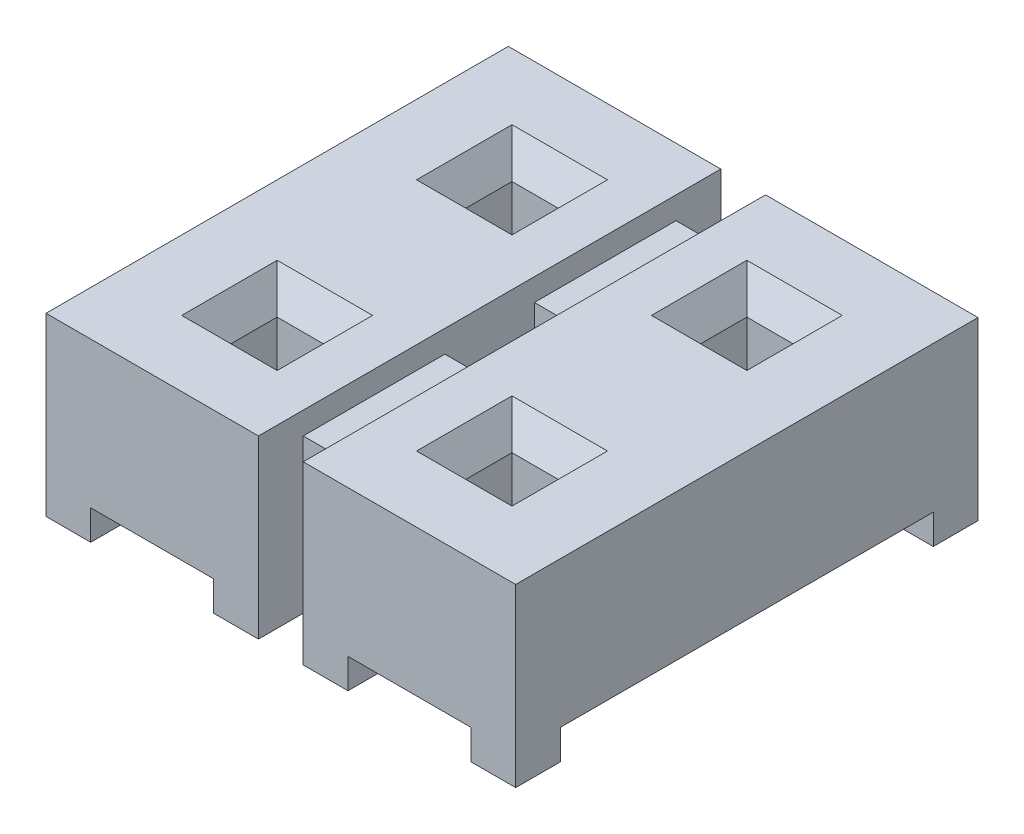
ISO-10303-21;
HEADER;
FILE_DESCRIPTION(('STEP AP214'),'2;1');
FILE_NAME('part.step','',(''),(''),'','','');
FILE_SCHEMA(('AUTOMOTIVE_DESIGN { 1 0 10303 214 1 1 1 1 }'));
ENDSEC;
DATA;
#1=APPLICATION_CONTEXT('core data for automotive mechanical design processes');
#2=APPLICATION_PROTOCOL_DEFINITION('international standard','automotive_design',2000,#1);
#3=PRODUCT_CONTEXT('',#1,'mechanical');
#4=PRODUCT('Part','Part','',(#3));
#5=PRODUCT_RELATED_PRODUCT_CATEGORY('part','',(#4));
#6=PRODUCT_DEFINITION_FORMATION('','',#4);
#7=PRODUCT_DEFINITION_CONTEXT('part definition',#1,'design');
#8=PRODUCT_DEFINITION('design','',#6,#7);
#9=PRODUCT_DEFINITION_SHAPE('','',#8);
#10=(LENGTH_UNIT() NAMED_UNIT(*) SI_UNIT(.MILLI.,.METRE.));
#11=(NAMED_UNIT(*) PLANE_ANGLE_UNIT() SI_UNIT($,.RADIAN.));
#12=(NAMED_UNIT(*) SI_UNIT($,.STERADIAN.) SOLID_ANGLE_UNIT());
#13=UNCERTAINTY_MEASURE_WITH_UNIT(LENGTH_MEASURE(1.E-05),#10,'distance_accuracy_value','');
#14=(GEOMETRIC_REPRESENTATION_CONTEXT(3) GLOBAL_UNCERTAINTY_ASSIGNED_CONTEXT((#13)) GLOBAL_UNIT_ASSIGNED_CONTEXT((#10,
#11,#12)) REPRESENTATION_CONTEXT('',''));
#15=CARTESIAN_POINT('',(0.,0.,0.));
#16=DIRECTION('',(0.,0.,1.));
#17=DIRECTION('',(1.,0.,0.));
#18=AXIS2_PLACEMENT_3D('',#15,#16,#17);
#19=CARTESIAN_POINT('',(1.999996,-0.8763,1.9685));
#20=DIRECTION('',(0.,-1.,0.));
#21=DIRECTION('',(0.,0.,-1.));
#22=AXIS2_PLACEMENT_3D('',#19,#20,#21);
#23=PLANE('',#22);
#24=DIRECTION('',(0.,0.,1.));
#25=VECTOR('',#24,1.);
#26=CARTESIAN_POINT('',(1.618996,-0.8763,1.5875));
#27=LINE('',#26,#25);
#28=CARTESIAN_POINT('',(1.618996,-0.8763,1.5875));
#29=VERTEX_POINT('',#28);
#30=CARTESIAN_POINT('',(1.618996,-0.8763,1.9685));
#31=VERTEX_POINT('',#30);
#32=EDGE_CURVE('E660',#29,#31,#27,.T.);
#33=ORIENTED_EDGE('',*,*,#32,.F.);
#34=DIRECTION('',(1.,0.,0.));
#35=VECTOR('',#34,1.);
#36=CARTESIAN_POINT('',(1.618996,-0.8763,1.5875));
#37=LINE('',#36,#35);
#38=CARTESIAN_POINT('',(1.999996,-0.8763,1.5875));
#39=VERTEX_POINT('',#38);
#40=EDGE_CURVE('E655',#29,#39,#37,.T.);
#41=ORIENTED_EDGE('',*,*,#40,.T.);
#42=DIRECTION('',(0.,0.,1.));
#43=VECTOR('',#42,1.);
#44=CARTESIAN_POINT('',(1.999996,-0.8763,1.9685));
#45=LINE('',#44,#43);
#46=CARTESIAN_POINT('',(1.999996,-0.8763,1.9685));
#47=VERTEX_POINT('',#46);
#48=EDGE_CURVE('E635',#39,#47,#45,.T.);
#49=ORIENTED_EDGE('',*,*,#48,.T.);
#50=DIRECTION('',(1.,0.,0.));
#51=VECTOR('',#50,1.);
#52=CARTESIAN_POINT('',(1.999996,-0.8763,1.9685));
#53=LINE('',#52,#51);
#54=EDGE_CURVE('E644',#31,#47,#53,.T.);
#55=ORIENTED_EDGE('',*,*,#54,.F.);
#56=EDGE_LOOP('',(#33,#41,#49,#55));
#57=FACE_BOUND('',#56,.T.);
#58=ADVANCED_FACE('F17',(#57),#23,.T.);
#59=CARTESIAN_POINT('',(1.999996,-0.8763,-1.9685));
#60=DIRECTION('',(0.,1.,0.));
#61=DIRECTION('',(0.,0.,1.));
#62=AXIS2_PLACEMENT_3D('',#59,#60,#61);
#63=PLANE('',#62);
#64=DIRECTION('',(1.,0.,0.));
#65=VECTOR('',#64,1.);
#66=CARTESIAN_POINT('',(1.618996,-0.8763,-1.5875));
#67=LINE('',#66,#65);
#68=CARTESIAN_POINT('',(1.618996,-0.8763,-1.5875));
#69=VERTEX_POINT('',#68);
#70=CARTESIAN_POINT('',(1.999996,-0.8763,-1.5875));
#71=VERTEX_POINT('',#70);
#72=EDGE_CURVE('E549',#69,#71,#67,.T.);
#73=ORIENTED_EDGE('',*,*,#72,.F.);
#74=DIRECTION('',(0.,0.,-1.));
#75=VECTOR('',#74,1.);
#76=CARTESIAN_POINT('',(1.618996,-0.8763,-1.5875));
#77=LINE('',#76,#75);
#78=CARTESIAN_POINT('',(1.618996,-0.8763,-1.9685));
#79=VERTEX_POINT('',#78);
#80=EDGE_CURVE('E662',#69,#79,#77,.T.);
#81=ORIENTED_EDGE('',*,*,#80,.T.);
#82=DIRECTION('',(-1.,0.,0.));
#83=VECTOR('',#82,1.);
#84=CARTESIAN_POINT('',(-1.999996,-0.8763,-1.9685));
#85=LINE('',#84,#83);
#86=CARTESIAN_POINT('',(1.999996,-0.8763,-1.9685));
#87=VERTEX_POINT('',#86);
#88=EDGE_CURVE('E622',#87,#79,#85,.T.);
#89=ORIENTED_EDGE('',*,*,#88,.F.);
#90=DIRECTION('',(0.,0.,1.));
#91=VECTOR('',#90,1.);
#92=CARTESIAN_POINT('',(1.999996,-0.8763,1.9685));
#93=LINE('',#92,#91);
#94=EDGE_CURVE('E642',#87,#71,#93,.T.);
#95=ORIENTED_EDGE('',*,*,#94,.T.);
#96=EDGE_LOOP('',(#73,#81,#89,#95));
#97=FACE_BOUND('',#96,.T.);
#98=ADVANCED_FACE('F858',(#97),#63,.F.);
#99=CARTESIAN_POINT('',(0.758698,-0.6223,1.241298));
#100=DIRECTION('',(0.,0.,1.));
#101=DIRECTION('',(1.,0.,0.));
#102=AXIS2_PLACEMENT_3D('',#99,#100,#101);
#103=PLANE('',#102);
#104=DIRECTION('',(1.,0.,0.));
#105=VECTOR('',#104,1.);
#106=CARTESIAN_POINT('',(0.,-0.36829999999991,1.24129800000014));
#107=LINE('',#106,#105);
#108=CARTESIAN_POINT('',(1.241298,-0.368299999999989,1.24129800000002));
#109=VERTEX_POINT('',#108);
#110=CARTESIAN_POINT('',(0.758698,-0.368299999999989,1.24129800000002));
#111=VERTEX_POINT('',#110);
#112=EDGE_CURVE('E526',#109,#111,#107,.F.);
#113=ORIENTED_EDGE('',*,*,#112,.T.);
#114=DIRECTION('',(0.,1.,0.));
#115=VECTOR('',#114,1.);
#116=CARTESIAN_POINT('',(0.758698,-0.6223,1.241298));
#117=LINE('',#116,#115);
#118=CARTESIAN_POINT('',(0.758697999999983,0.368299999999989,1.241298));
#119=VERTEX_POINT('',#118);
#120=EDGE_CURVE('E20',#119,#111,#117,.F.);
#121=ORIENTED_EDGE('',*,*,#120,.F.);
#122=DIRECTION('',(1.,0.,0.));
#123=VECTOR('',#122,1.);
#124=CARTESIAN_POINT('',(0.758698,0.3683,1.241298));
#125=LINE('',#124,#123);
#126=CARTESIAN_POINT('',(1.24129800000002,0.368299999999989,1.241298));
#127=VERTEX_POINT('',#126);
#128=EDGE_CURVE('E617',#127,#119,#125,.F.);
#129=ORIENTED_EDGE('',*,*,#128,.F.);
#130=DIRECTION('',(0.,1.,0.));
#131=VECTOR('',#130,1.);
#132=CARTESIAN_POINT('',(1.241298,-0.6223,1.241298));
#133=LINE('',#132,#131);
#134=EDGE_CURVE('E507',#109,#127,#133,.T.);
#135=ORIENTED_EDGE('',*,*,#134,.F.);
#136=EDGE_LOOP('',(#113,#121,#129,#135));
#137=FACE_BOUND('',#136,.T.);
#138=ADVANCED_FACE('F527',(#137),#103,.F.);
#139=CARTESIAN_POINT('',(0.758698,-0.6223,1.241298));
#140=DIRECTION('',(1.,0.,0.));
#141=DIRECTION('',(0.,0.,-1.));
#142=AXIS2_PLACEMENT_3D('',#139,#140,#141);
#143=PLANE('',#142);
#144=DIRECTION('',(0.,1.,0.));
#145=VECTOR('',#144,1.);
#146=CARTESIAN_POINT('',(0.758698,-0.6223,0.758698));
#147=LINE('',#146,#145);
#148=CARTESIAN_POINT('',(0.758698,-0.368299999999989,0.758697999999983));
#149=VERTEX_POINT('',#148);
#150=CARTESIAN_POINT('',(0.758697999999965,0.368299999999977,0.758698));
#151=VERTEX_POINT('',#150);
#152=EDGE_CURVE('E512',#149,#151,#147,.T.);
#153=ORIENTED_EDGE('',*,*,#152,.T.);
#154=DIRECTION('',(0.,0.,1.));
#155=VECTOR('',#154,1.);
#156=CARTESIAN_POINT('',(0.758697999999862,0.36829999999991,-1.9685));
#157=LINE('',#156,#155);
#158=EDGE_CURVE('E522',#151,#119,#157,.T.);
#159=ORIENTED_EDGE('',*,*,#158,.T.);
#160=ORIENTED_EDGE('',*,*,#120,.T.);
#161=DIRECTION('',(0.,0.,1.));
#162=VECTOR('',#161,1.);
#163=CARTESIAN_POINT('',(0.758698,-0.3683,1.241298));
#164=LINE('',#163,#162);
#165=EDGE_CURVE('E520',#149,#111,#164,.T.);
#166=ORIENTED_EDGE('',*,*,#165,.F.);
#167=EDGE_LOOP('',(#153,#159,#160,#166));
#168=FACE_BOUND('',#167,.T.);
#169=ADVANCED_FACE('F518',(#168),#143,.T.);
#170=CARTESIAN_POINT('',(1.241298,-0.6223,0.758698));
#171=DIRECTION('',(0.,0.,-1.));
#172=DIRECTION('',(-1.,0.,0.));
#173=AXIS2_PLACEMENT_3D('',#170,#171,#172);
#174=PLANE('',#173);
#175=DIRECTION('',(1.,0.,0.));
#176=VECTOR('',#175,1.);
#177=CARTESIAN_POINT('',(0.,-0.36829999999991,0.758697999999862));
#178=LINE('',#177,#176);
#179=CARTESIAN_POINT('',(1.241298,-0.368299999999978,0.758697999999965));
#180=VERTEX_POINT('',#179);
#181=EDGE_CURVE('E558',#149,#180,#178,.T.);
#182=ORIENTED_EDGE('',*,*,#181,.T.);
#183=DIRECTION('',(0.,1.,0.));
#184=VECTOR('',#183,1.);
#185=CARTESIAN_POINT('',(1.241298,-0.6223,0.758698));
#186=LINE('',#185,#184);
#187=CARTESIAN_POINT('',(1.24129800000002,0.368299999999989,0.758698));
#188=VERTEX_POINT('',#187);
#189=EDGE_CURVE('E510',#188,#180,#186,.F.);
#190=ORIENTED_EDGE('',*,*,#189,.F.);
#191=DIRECTION('',(1.,0.,0.));
#192=VECTOR('',#191,1.);
#193=CARTESIAN_POINT('',(1.241298,0.3683,0.758698));
#194=LINE('',#193,#192);
#195=EDGE_CURVE('E608',#151,#188,#194,.T.);
#196=ORIENTED_EDGE('',*,*,#195,.F.);
#197=ORIENTED_EDGE('',*,*,#152,.F.);
#198=EDGE_LOOP('',(#182,#190,#196,#197));
#199=FACE_BOUND('',#198,.T.);
#200=ADVANCED_FACE('F1145',(#199),#174,.F.);
#201=CARTESIAN_POINT('',(1.241298,-0.6223,0.758698));
#202=DIRECTION('',(-1.,0.,0.));
#203=DIRECTION('',(0.,0.,1.));
#204=AXIS2_PLACEMENT_3D('',#201,#202,#203);
#205=PLANE('',#204);
#206=ORIENTED_EDGE('',*,*,#134,.T.);
#207=DIRECTION('',(0.,0.,1.));
#208=VECTOR('',#207,1.);
#209=CARTESIAN_POINT('',(1.24129800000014,0.36829999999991,-1.9685));
#210=LINE('',#209,#208);
#211=EDGE_CURVE('E602',#127,#188,#210,.F.);
#212=ORIENTED_EDGE('',*,*,#211,.T.);
#213=ORIENTED_EDGE('',*,*,#189,.T.);
#214=DIRECTION('',(0.,0.,1.));
#215=VECTOR('',#214,1.);
#216=CARTESIAN_POINT('',(1.241298,-0.3683,0.758698));
#217=LINE('',#216,#215);
#218=EDGE_CURVE('E533',#109,#180,#217,.F.);
#219=ORIENTED_EDGE('',*,*,#218,.F.);
#220=EDGE_LOOP('',(#206,#212,#213,#219));
#221=FACE_BOUND('',#220,.T.);
#222=ADVANCED_FACE('F1148',(#221),#205,.T.);
#223=CARTESIAN_POINT('',(1.241298,-0.6223,-0.758698));
#224=DIRECTION('',(0.,0.,1.));
#225=DIRECTION('',(1.,0.,0.));
#226=AXIS2_PLACEMENT_3D('',#223,#224,#225);
#227=PLANE('',#226);
#228=DIRECTION('',(1.,0.,0.));
#229=VECTOR('',#228,1.);
#230=CARTESIAN_POINT('',(1.241298,0.3683,-0.758698));
#231=LINE('',#230,#229);
#232=CARTESIAN_POINT('',(1.24129800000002,0.368299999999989,-0.758698));
#233=VERTEX_POINT('',#232);
#234=CARTESIAN_POINT('',(0.758697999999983,0.368299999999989,-0.758698));
#235=VERTEX_POINT('',#234);
#236=EDGE_CURVE('E471',#233,#235,#231,.F.);
#237=ORIENTED_EDGE('',*,*,#236,.F.);
#238=DIRECTION('',(0.,1.,0.));
#239=VECTOR('',#238,1.);
#240=CARTESIAN_POINT('',(1.241298,-0.6223,-0.758698));
#241=LINE('',#240,#239);
#242=CARTESIAN_POINT('',(1.241298,-0.368299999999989,-0.758697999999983));
#243=VERTEX_POINT('',#242);
#244=EDGE_CURVE('E467',#243,#233,#241,.T.);
#245=ORIENTED_EDGE('',*,*,#244,.F.);
#246=DIRECTION('',(1.,0.,0.));
#247=VECTOR('',#246,1.);
#248=CARTESIAN_POINT('',(0.,-0.36829999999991,-0.758697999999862));
#249=LINE('',#248,#247);
#250=CARTESIAN_POINT('',(0.758698,-0.368299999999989,-0.758697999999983));
#251=VERTEX_POINT('',#250);
#252=EDGE_CURVE('E464',#243,#251,#249,.F.);
#253=ORIENTED_EDGE('',*,*,#252,.T.);
#254=DIRECTION('',(0.,1.,0.));
#255=VECTOR('',#254,1.);
#256=CARTESIAN_POINT('',(0.758698,-0.6223,-0.758698));
#257=LINE('',#256,#255);
#258=EDGE_CURVE('E505',#235,#251,#257,.F.);
#259=ORIENTED_EDGE('',*,*,#258,.F.);
#260=EDGE_LOOP('',(#237,#245,#253,#259));
#261=FACE_BOUND('',#260,.T.);
#262=ADVANCED_FACE('F469',(#261),#227,.F.);
#263=CARTESIAN_POINT('',(0.758698,-0.6223,-1.241298));
#264=DIRECTION('',(1.,0.,0.));
#265=DIRECTION('',(0.,0.,-1.));
#266=AXIS2_PLACEMENT_3D('',#263,#264,#265);
#267=PLANE('',#266);
#268=ORIENTED_EDGE('',*,*,#258,.T.);
#269=DIRECTION('',(0.,0.,1.));
#270=VECTOR('',#269,1.);
#271=CARTESIAN_POINT('',(0.758698,-0.3683,-1.241298));
#272=LINE('',#271,#270);
#273=CARTESIAN_POINT('',(0.758698,-0.368299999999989,-1.24129800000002));
#274=VERTEX_POINT('',#273);
#275=EDGE_CURVE('E493',#274,#251,#272,.T.);
#276=ORIENTED_EDGE('',*,*,#275,.F.);
#277=DIRECTION('',(0.,1.,0.));
#278=VECTOR('',#277,1.);
#279=CARTESIAN_POINT('',(0.758698,-0.6223,-1.241298));
#280=LINE('',#279,#278);
#281=CARTESIAN_POINT('',(0.758697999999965,0.368299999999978,-1.241298));
#282=VERTEX_POINT('',#281);
#283=EDGE_CURVE('E476',#274,#282,#280,.T.);
#284=ORIENTED_EDGE('',*,*,#283,.T.);
#285=DIRECTION('',(0.,0.,1.));
#286=VECTOR('',#285,1.);
#287=CARTESIAN_POINT('',(0.758697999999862,0.36829999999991,1.9685));
#288=LINE('',#287,#286);
#289=EDGE_CURVE('E576',#282,#235,#288,.T.);
#290=ORIENTED_EDGE('',*,*,#289,.T.);
#291=EDGE_LOOP('',(#268,#276,#284,#290));
#292=FACE_BOUND('',#291,.T.);
#293=ADVANCED_FACE('F573',(#292),#267,.T.);
#294=CARTESIAN_POINT('',(0.758698,-0.6223,-1.241298));
#295=DIRECTION('',(0.,0.,-1.));
#296=DIRECTION('',(-1.,0.,0.));
#297=AXIS2_PLACEMENT_3D('',#294,#295,#296);
#298=PLANE('',#297);
#299=DIRECTION('',(1.,0.,0.));
#300=VECTOR('',#299,1.);
#301=CARTESIAN_POINT('',(0.758698,0.3683,-1.241298));
#302=LINE('',#301,#300);
#303=CARTESIAN_POINT('',(1.24129800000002,0.368299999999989,-1.241298));
#304=VERTEX_POINT('',#303);
#305=EDGE_CURVE('E597',#282,#304,#302,.T.);
#306=ORIENTED_EDGE('',*,*,#305,.F.);
#307=ORIENTED_EDGE('',*,*,#283,.F.);
#308=DIRECTION('',(1.,0.,0.));
#309=VECTOR('',#308,1.);
#310=CARTESIAN_POINT('',(0.,-0.36829999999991,-1.24129800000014));
#311=LINE('',#310,#309);
#312=CARTESIAN_POINT('',(1.241298,-0.368299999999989,-1.24129800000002));
#313=VERTEX_POINT('',#312);
#314=EDGE_CURVE('E562',#274,#313,#311,.T.);
#315=ORIENTED_EDGE('',*,*,#314,.T.);
#316=DIRECTION('',(0.,1.,0.));
#317=VECTOR('',#316,1.);
#318=CARTESIAN_POINT('',(1.241298,-0.6223,-1.241298));
#319=LINE('',#318,#317);
#320=EDGE_CURVE('E475',#304,#313,#319,.F.);
#321=ORIENTED_EDGE('',*,*,#320,.F.);
#322=EDGE_LOOP('',(#306,#307,#315,#321));
#323=FACE_BOUND('',#322,.T.);
#324=ADVANCED_FACE('F1157',(#323),#298,.F.);
#325=CARTESIAN_POINT('',(1.241298,-0.6223,-0.758698));
#326=DIRECTION('',(-1.,0.,0.));
#327=DIRECTION('',(0.,0.,1.));
#328=AXIS2_PLACEMENT_3D('',#325,#326,#327);
#329=PLANE('',#328);
#330=ORIENTED_EDGE('',*,*,#320,.T.);
#331=DIRECTION('',(0.,0.,1.));
#332=VECTOR('',#331,1.);
#333=CARTESIAN_POINT('',(1.241298,-0.3683,-0.758698));
#334=LINE('',#333,#332);
#335=EDGE_CURVE('E479',#243,#313,#334,.F.);
#336=ORIENTED_EDGE('',*,*,#335,.F.);
#337=ORIENTED_EDGE('',*,*,#244,.T.);
#338=DIRECTION('',(0.,0.,1.));
#339=VECTOR('',#338,1.);
#340=CARTESIAN_POINT('',(1.24129800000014,0.36829999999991,1.9685));
#341=LINE('',#340,#339);
#342=EDGE_CURVE('E724',#233,#304,#341,.F.);
#343=ORIENTED_EDGE('',*,*,#342,.T.);
#344=EDGE_LOOP('',(#330,#336,#337,#343));
#345=FACE_BOUND('',#344,.T.);
#346=ADVANCED_FACE('F481',(#345),#329,.T.);
#347=CARTESIAN_POINT('',(1.241298,-0.3683,-0.758698));
#348=DIRECTION('',(-0.838443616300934,-0.544988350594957,0.));
#349=DIRECTION('',(0.544988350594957,-0.838443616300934,0.));
#350=AXIS2_PLACEMENT_3D('',#347,#348,#349);
#351=PLANE('',#350);
#352=DIRECTION('',(0.478536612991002,-0.736210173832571,-0.478536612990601));
#353=VECTOR('',#352,1.);
#354=CARTESIAN_POINT('',(1.241298,-0.36829999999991,-1.24129800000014));
#355=LINE('',#354,#353);
#356=CARTESIAN_POINT('',(1.40639799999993,-0.622300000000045,-1.406398));
#357=VERTEX_POINT('',#356);
#358=EDGE_CURVE('E540',#313,#357,#355,.T.);
#359=ORIENTED_EDGE('',*,*,#358,.T.);
#360=DIRECTION('',(0.,0.,1.));
#361=VECTOR('',#360,1.);
#362=CARTESIAN_POINT('',(1.406398,-0.6223,-1.9685));
#363=LINE('',#362,#361);
#364=CARTESIAN_POINT('',(1.40639799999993,-0.622300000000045,-0.593598));
#365=VERTEX_POINT('',#364);
#366=EDGE_CURVE('E490',#357,#365,#363,.T.);
#367=ORIENTED_EDGE('',*,*,#366,.T.);
#368=DIRECTION('',(-0.478536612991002,0.736210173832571,-0.4785366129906));
#369=VECTOR('',#368,1.);
#370=CARTESIAN_POINT('',(1.406398,-0.6223,-0.593598));
#371=LINE('',#370,#369);
#372=EDGE_CURVE('E487',#365,#243,#371,.T.);
#373=ORIENTED_EDGE('',*,*,#372,.T.);
#374=ORIENTED_EDGE('',*,*,#335,.T.);
#375=EDGE_LOOP('',(#359,#367,#373,#374));
#376=FACE_BOUND('',#375,.T.);
#377=ADVANCED_FACE('F488',(#376),#351,.T.);
#378=CARTESIAN_POINT('',(0.,-0.6223,-0.593598));
#379=DIRECTION('',(0.,0.544988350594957,0.838443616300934));
#380=DIRECTION('',(0.,-0.838443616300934,0.544988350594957));
#381=AXIS2_PLACEMENT_3D('',#378,#379,#380);
#382=PLANE('',#381);
#383=DIRECTION('',(1.,0.,0.));
#384=VECTOR('',#383,1.);
#385=CARTESIAN_POINT('',(-1.999996,-0.6223,-0.593598));
#386=LINE('',#385,#384);
#387=CARTESIAN_POINT('',(0.593598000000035,-0.622300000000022,-0.593598));
#388=VERTEX_POINT('',#387);
#389=EDGE_CURVE('E709',#365,#388,#386,.F.);
#390=ORIENTED_EDGE('',*,*,#389,.T.);
#391=DIRECTION('',(-0.4785366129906,-0.736210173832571,0.478536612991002));
#392=VECTOR('',#391,1.);
#393=CARTESIAN_POINT('',(0.758698,-0.3683,-0.758698));
#394=LINE('',#393,#392);
#395=EDGE_CURVE('E498',#251,#388,#394,.T.);
#396=ORIENTED_EDGE('',*,*,#395,.F.);
#397=ORIENTED_EDGE('',*,*,#252,.F.);
#398=ORIENTED_EDGE('',*,*,#372,.F.);
#399=EDGE_LOOP('',(#390,#396,#397,#398));
#400=FACE_BOUND('',#399,.T.);
#401=ADVANCED_FACE('F496',(#400),#382,.F.);
#402=CARTESIAN_POINT('',(0.758698,-0.3683,-1.241298));
#403=DIRECTION('',(0.838443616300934,-0.544988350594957,0.));
#404=DIRECTION('',(0.544988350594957,0.838443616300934,0.));
#405=AXIS2_PLACEMENT_3D('',#402,#403,#404);
#406=PLANE('',#405);
#407=ORIENTED_EDGE('',*,*,#395,.T.);
#408=DIRECTION('',(0.,0.,1.));
#409=VECTOR('',#408,1.);
#410=CARTESIAN_POINT('',(0.593598,-0.6223,-1.9685));
#411=LINE('',#410,#409);
#412=CARTESIAN_POINT('',(0.593598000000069,-0.622300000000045,-1.406398));
#413=VERTEX_POINT('',#412);
#414=EDGE_CURVE('E707',#388,#413,#411,.F.);
#415=ORIENTED_EDGE('',*,*,#414,.T.);
#416=DIRECTION('',(0.478536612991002,0.736210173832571,0.4785366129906));
#417=VECTOR('',#416,1.);
#418=CARTESIAN_POINT('',(0.593598,-0.6223,-1.406398));
#419=LINE('',#418,#417);
#420=EDGE_CURVE('E564',#413,#274,#419,.T.);
#421=ORIENTED_EDGE('',*,*,#420,.T.);
#422=ORIENTED_EDGE('',*,*,#275,.T.);
#423=EDGE_LOOP('',(#407,#415,#421,#422));
#424=FACE_BOUND('',#423,.T.);
#425=ADVANCED_FACE('F568',(#424),#406,.T.);
#426=CARTESIAN_POINT('',(0.,-0.6223,-1.406398));
#427=DIRECTION('',(0.,0.544988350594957,-0.838443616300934));
#428=DIRECTION('',(0.,0.838443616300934,0.544988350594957));
#429=AXIS2_PLACEMENT_3D('',#426,#427,#428);
#430=PLANE('',#429);
#431=ORIENTED_EDGE('',*,*,#314,.F.);
#432=ORIENTED_EDGE('',*,*,#420,.F.);
#433=DIRECTION('',(1.,0.,0.));
#434=VECTOR('',#433,1.);
#435=CARTESIAN_POINT('',(-1.999996,-0.6223,-1.406398));
#436=LINE('',#435,#434);
#437=EDGE_CURVE('E704',#413,#357,#436,.T.);
#438=ORIENTED_EDGE('',*,*,#437,.T.);
#439=ORIENTED_EDGE('',*,*,#358,.F.);
#440=EDGE_LOOP('',(#431,#432,#438,#439));
#441=FACE_BOUND('',#440,.T.);
#442=ADVANCED_FACE('F1168',(#441),#430,.F.);
#443=CARTESIAN_POINT('',(0.758698,-0.3683,1.241298));
#444=DIRECTION('',(0.838443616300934,-0.544988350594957,0.));
#445=DIRECTION('',(0.544988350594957,0.838443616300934,0.));
#446=AXIS2_PLACEMENT_3D('',#443,#444,#445);
#447=PLANE('',#446);
#448=DIRECTION('',(0.478536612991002,0.736210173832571,0.4785366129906));
#449=VECTOR('',#448,1.);
#450=CARTESIAN_POINT('',(0.593598,-0.6223,0.593598));
#451=LINE('',#450,#449);
#452=CARTESIAN_POINT('',(0.593598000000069,-0.622300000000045,0.593598));
#453=VERTEX_POINT('',#452);
#454=EDGE_CURVE('E539',#453,#149,#451,.T.);
#455=ORIENTED_EDGE('',*,*,#454,.T.);
#456=ORIENTED_EDGE('',*,*,#165,.T.);
#457=DIRECTION('',(-0.478536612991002,-0.736210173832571,0.4785366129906));
#458=VECTOR('',#457,1.);
#459=CARTESIAN_POINT('',(0.758698,-0.36829999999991,1.24129800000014));
#460=LINE('',#459,#458);
#461=CARTESIAN_POINT('',(0.593598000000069,-0.622300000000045,1.406398));
#462=VERTEX_POINT('',#461);
#463=EDGE_CURVE('E532',#111,#462,#460,.T.);
#464=ORIENTED_EDGE('',*,*,#463,.T.);
#465=DIRECTION('',(0.,0.,1.));
#466=VECTOR('',#465,1.);
#467=CARTESIAN_POINT('',(0.593598,-0.6223,-1.9685));
#468=LINE('',#467,#466);
#469=EDGE_CURVE('E702',#462,#453,#468,.F.);
#470=ORIENTED_EDGE('',*,*,#469,.T.);
#471=EDGE_LOOP('',(#455,#456,#464,#470));
#472=FACE_BOUND('',#471,.T.);
#473=ADVANCED_FACE('F536',(#472),#447,.T.);
#474=CARTESIAN_POINT('',(0.,-0.6223,0.593598));
#475=DIRECTION('',(0.,0.544988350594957,-0.838443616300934));
#476=DIRECTION('',(0.,0.838443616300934,0.544988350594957));
#477=AXIS2_PLACEMENT_3D('',#474,#475,#476);
#478=PLANE('',#477);
#479=ORIENTED_EDGE('',*,*,#181,.F.);
#480=ORIENTED_EDGE('',*,*,#454,.F.);
#481=DIRECTION('',(1.,0.,0.));
#482=VECTOR('',#481,1.);
#483=CARTESIAN_POINT('',(-1.999996,-0.6223,0.593598));
#484=LINE('',#483,#482);
#485=CARTESIAN_POINT('',(1.40639799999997,-0.622300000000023,0.593598));
#486=VERTEX_POINT('',#485);
#487=EDGE_CURVE('E700',#453,#486,#484,.T.);
#488=ORIENTED_EDGE('',*,*,#487,.T.);
#489=DIRECTION('',(0.4785366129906,-0.736210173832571,-0.478536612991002));
#490=VECTOR('',#489,1.);
#491=CARTESIAN_POINT('',(1.241298,-0.3683,0.758698));
#492=LINE('',#491,#490);
#493=EDGE_CURVE('E555',#180,#486,#492,.T.);
#494=ORIENTED_EDGE('',*,*,#493,.F.);
#495=EDGE_LOOP('',(#479,#480,#488,#494));
#496=FACE_BOUND('',#495,.T.);
#497=ADVANCED_FACE('F1174',(#496),#478,.F.);
#498=CARTESIAN_POINT('',(1.241298,-0.3683,0.758698));
#499=DIRECTION('',(-0.838443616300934,-0.544988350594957,0.));
#500=DIRECTION('',(0.544988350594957,-0.838443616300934,0.));
#501=AXIS2_PLACEMENT_3D('',#498,#499,#500);
#502=PLANE('',#501);
#503=DIRECTION('',(-0.478536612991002,0.736210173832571,-0.478536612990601));
#504=VECTOR('',#503,1.);
#505=CARTESIAN_POINT('',(1.406398,-0.6223,1.406398));
#506=LINE('',#505,#504);
#507=CARTESIAN_POINT('',(1.40639799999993,-0.622300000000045,1.406398));
#508=VERTEX_POINT('',#507);
#509=EDGE_CURVE('E546',#508,#109,#506,.T.);
#510=ORIENTED_EDGE('',*,*,#509,.T.);
#511=ORIENTED_EDGE('',*,*,#218,.T.);
#512=ORIENTED_EDGE('',*,*,#493,.T.);
#513=DIRECTION('',(0.,0.,1.));
#514=VECTOR('',#513,1.);
#515=CARTESIAN_POINT('',(1.406398,-0.6223,-1.9685));
#516=LINE('',#515,#514);
#517=EDGE_CURVE('E698',#486,#508,#516,.T.);
#518=ORIENTED_EDGE('',*,*,#517,.T.);
#519=EDGE_LOOP('',(#510,#511,#512,#518));
#520=FACE_BOUND('',#519,.T.);
#521=ADVANCED_FACE('F1177',(#520),#502,.T.);
#522=CARTESIAN_POINT('',(0.,-0.6223,1.406398));
#523=DIRECTION('',(0.,0.544988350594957,0.838443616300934));
#524=DIRECTION('',(0.,-0.838443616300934,0.544988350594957));
#525=AXIS2_PLACEMENT_3D('',#522,#523,#524);
#526=PLANE('',#525);
#527=DIRECTION('',(1.,0.,0.));
#528=VECTOR('',#527,1.);
#529=CARTESIAN_POINT('',(-1.999996,-0.6223,1.406398));
#530=LINE('',#529,#528);
#531=EDGE_CURVE('E544',#508,#462,#530,.F.);
#532=ORIENTED_EDGE('',*,*,#531,.T.);
#533=ORIENTED_EDGE('',*,*,#463,.F.);
#534=ORIENTED_EDGE('',*,*,#112,.F.);
#535=ORIENTED_EDGE('',*,*,#509,.F.);
#536=EDGE_LOOP('',(#532,#533,#534,#535));
#537=FACE_BOUND('',#536,.T.);
#538=ADVANCED_FACE('F542',(#537),#526,.F.);
#539=CARTESIAN_POINT('',(1.618996,-0.8763,-1.5875));
#540=DIRECTION('',(0.,0.,1.));
#541=DIRECTION('',(1.,0.,0.));
#542=AXIS2_PLACEMENT_3D('',#539,#540,#541);
#543=PLANE('',#542);
#544=ORIENTED_EDGE('',*,*,#72,.T.);
#545=DIRECTION('',(0.,1.,0.));
#546=VECTOR('',#545,1.);
#547=CARTESIAN_POINT('',(1.999996,0.6223,-1.5875));
#548=LINE('',#547,#546);
#549=CARTESIAN_POINT('',(1.999996,-0.6223,-1.5875));
#550=VERTEX_POINT('',#549);
#551=EDGE_CURVE('E640',#71,#550,#548,.T.);
#552=ORIENTED_EDGE('',*,*,#551,.T.);
#553=DIRECTION('',(1.,0.,0.));
#554=VECTOR('',#553,1.);
#555=CARTESIAN_POINT('',(-1.999996,-0.6223,-1.5875));
#556=LINE('',#555,#554);
#557=CARTESIAN_POINT('',(1.618996,-0.6223,-1.5875));
#558=VERTEX_POINT('',#557);
#559=EDGE_CURVE('E684',#550,#558,#556,.F.);
#560=ORIENTED_EDGE('',*,*,#559,.T.);
#561=DIRECTION('',(0.,1.,0.));
#562=VECTOR('',#561,1.);
#563=CARTESIAN_POINT('',(1.618996,-0.8763,-1.5875));
#564=LINE('',#563,#562);
#565=EDGE_CURVE('E664',#558,#69,#564,.F.);
#566=ORIENTED_EDGE('',*,*,#565,.T.);
#567=EDGE_LOOP('',(#544,#552,#560,#566));
#568=FACE_BOUND('',#567,.T.);
#569=ADVANCED_FACE('F669',(#568),#543,.T.);
#570=CARTESIAN_POINT('',(1.618996,-0.8763,-1.5875));
#571=DIRECTION('',(1.,0.,0.));
#572=DIRECTION('',(0.,0.,-1.));
#573=AXIS2_PLACEMENT_3D('',#570,#571,#572);
#574=PLANE('',#573);
#575=DIRECTION('',(0.,1.,0.));
#576=VECTOR('',#575,1.);
#577=CARTESIAN_POINT('',(1.618996,0.6223,-1.9685));
#578=LINE('',#577,#576);
#579=CARTESIAN_POINT('',(1.618996,-0.6223,-1.9685));
#580=VERTEX_POINT('',#579);
#581=EDGE_CURVE('E619',#79,#580,#578,.T.);
#582=ORIENTED_EDGE('',*,*,#581,.F.);
#583=ORIENTED_EDGE('',*,*,#80,.F.);
#584=ORIENTED_EDGE('',*,*,#565,.F.);
#585=DIRECTION('',(0.,0.,1.));
#586=VECTOR('',#585,1.);
#587=CARTESIAN_POINT('',(1.618996,-0.6223,-1.9685));
#588=LINE('',#587,#586);
#589=EDGE_CURVE('E691',#558,#580,#588,.F.);
#590=ORIENTED_EDGE('',*,*,#589,.T.);
#591=EDGE_LOOP('',(#582,#583,#584,#590));
#592=FACE_BOUND('',#591,.T.);
#593=ADVANCED_FACE('F860',(#592),#574,.F.);
#594=CARTESIAN_POINT('',(0.5715,-0.8763,-1.5875));
#595=DIRECTION('',(1.,0.,0.));
#596=DIRECTION('',(0.,0.,-1.));
#597=AXIS2_PLACEMENT_3D('',#594,#595,#596);
#598=PLANE('',#597);
#599=DIRECTION('',(0.,0.,1.));
#600=VECTOR('',#599,1.);
#601=CARTESIAN_POINT('',(0.5715,-0.8763,-1.5875));
#602=LINE('',#601,#600);
#603=CARTESIAN_POINT('',(0.5715,-0.8763,-1.5875));
#604=VERTEX_POINT('',#603);
#605=CARTESIAN_POINT('',(0.571500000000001,-0.8763,-1.9685));
#606=VERTEX_POINT('',#605);
#607=EDGE_CURVE('E719',#604,#606,#602,.F.);
#608=ORIENTED_EDGE('',*,*,#607,.T.);
#609=DIRECTION('',(0.,1.,0.));
#610=VECTOR('',#609,1.);
#611=CARTESIAN_POINT('',(0.5715,0.6223,-1.9685));
#612=LINE('',#611,#610);
#613=CARTESIAN_POINT('',(0.5715,-0.6223,-1.9685));
#614=VERTEX_POINT('',#613);
#615=EDGE_CURVE('E630',#614,#606,#612,.F.);
#616=ORIENTED_EDGE('',*,*,#615,.F.);
#617=DIRECTION('',(0.,0.,1.));
#618=VECTOR('',#617,1.);
#619=CARTESIAN_POINT('',(0.5715,-0.6223,-1.9685));
#620=LINE('',#619,#618);
#621=CARTESIAN_POINT('',(0.5715,-0.6223,-1.5875));
#622=VERTEX_POINT('',#621);
#623=EDGE_CURVE('E794',#614,#622,#620,.T.);
#624=ORIENTED_EDGE('',*,*,#623,.T.);
#625=DIRECTION('',(0.,1.,0.));
#626=VECTOR('',#625,1.);
#627=CARTESIAN_POINT('',(0.5715,-0.8763,-1.5875));
#628=LINE('',#627,#626);
#629=EDGE_CURVE('E714',#622,#604,#628,.F.);
#630=ORIENTED_EDGE('',*,*,#629,.T.);
#631=EDGE_LOOP('',(#608,#616,#624,#630));
#632=FACE_BOUND('',#631,.T.);
#633=ADVANCED_FACE('F805',(#632),#598,.T.);
#634=CARTESIAN_POINT('',(1.618996,-0.8763,1.5875));
#635=DIRECTION('',(-1.,0.,0.));
#636=DIRECTION('',(0.,0.,1.));
#637=AXIS2_PLACEMENT_3D('',#634,#635,#636);
#638=PLANE('',#637);
#639=ORIENTED_EDGE('',*,*,#32,.T.);
#640=DIRECTION('',(0.,1.,0.));
#641=VECTOR('',#640,1.);
#642=CARTESIAN_POINT('',(1.618996,0.6223,1.9685));
#643=LINE('',#642,#641);
#644=CARTESIAN_POINT('',(1.618996,-0.6223,1.9685));
#645=VERTEX_POINT('',#644);
#646=EDGE_CURVE('E647',#645,#31,#643,.F.);
#647=ORIENTED_EDGE('',*,*,#646,.F.);
#648=DIRECTION('',(0.,0.,1.));
#649=VECTOR('',#648,1.);
#650=CARTESIAN_POINT('',(1.618996,-0.6223,-1.9685));
#651=LINE('',#650,#649);
#652=CARTESIAN_POINT('',(1.618996,-0.6223,1.5875));
#653=VERTEX_POINT('',#652);
#654=EDGE_CURVE('E785',#645,#653,#651,.F.);
#655=ORIENTED_EDGE('',*,*,#654,.T.);
#656=DIRECTION('',(0.,1.,0.));
#657=VECTOR('',#656,1.);
#658=CARTESIAN_POINT('',(1.618996,-0.8763,1.5875));
#659=LINE('',#658,#657);
#660=EDGE_CURVE('E657',#653,#29,#659,.F.);
#661=ORIENTED_EDGE('',*,*,#660,.T.);
#662=EDGE_LOOP('',(#639,#647,#655,#661));
#663=FACE_BOUND('',#662,.T.);
#664=ADVANCED_FACE('F868',(#663),#638,.T.);
#665=CARTESIAN_POINT('',(1.618996,-0.8763,1.5875));
#666=DIRECTION('',(0.,0.,1.));
#667=DIRECTION('',(1.,0.,0.));
#668=AXIS2_PLACEMENT_3D('',#665,#666,#667);
#669=PLANE('',#668);
#670=DIRECTION('',(0.,1.,0.));
#671=VECTOR('',#670,1.);
#672=CARTESIAN_POINT('',(1.999996,0.6223,1.5875));
#673=LINE('',#672,#671);
#674=CARTESIAN_POINT('',(1.999996,-0.6223,1.5875));
#675=VERTEX_POINT('',#674);
#676=EDGE_CURVE('E637',#675,#39,#673,.F.);
#677=ORIENTED_EDGE('',*,*,#676,.T.);
#678=ORIENTED_EDGE('',*,*,#40,.F.);
#679=ORIENTED_EDGE('',*,*,#660,.F.);
#680=DIRECTION('',(1.,0.,0.));
#681=VECTOR('',#680,1.);
#682=CARTESIAN_POINT('',(-1.999996,-0.6223,1.5875));
#683=LINE('',#682,#681);
#684=EDGE_CURVE('E783',#653,#675,#683,.T.);
#685=ORIENTED_EDGE('',*,*,#684,.T.);
#686=EDGE_LOOP('',(#677,#678,#679,#685));
#687=FACE_BOUND('',#686,.T.);
#688=ADVANCED_FACE('F1122',(#687),#669,.F.);
#689=CARTESIAN_POINT('',(0.5715,-0.8763,1.5875));
#690=DIRECTION('',(-1.,0.,0.));
#691=DIRECTION('',(0.,0.,1.));
#692=AXIS2_PLACEMENT_3D('',#689,#690,#691);
#693=PLANE('',#692);
#694=DIRECTION('',(0.,1.,0.));
#695=VECTOR('',#694,1.);
#696=CARTESIAN_POINT('',(0.5715,0.6223,1.9685));
#697=LINE('',#696,#695);
#698=CARTESIAN_POINT('',(0.5715,-0.8763,1.9685));
#699=VERTEX_POINT('',#698);
#700=CARTESIAN_POINT('',(0.571500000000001,-0.6223,1.9685));
#701=VERTEX_POINT('',#700);
#702=EDGE_CURVE('E650',#699,#701,#697,.T.);
#703=ORIENTED_EDGE('',*,*,#702,.F.);
#704=DIRECTION('',(0.,0.,1.));
#705=VECTOR('',#704,1.);
#706=CARTESIAN_POINT('',(0.5715,-0.8763,1.5875));
#707=LINE('',#706,#705);
#708=CARTESIAN_POINT('',(0.5715,-0.8763,1.5875));
#709=VERTEX_POINT('',#708);
#710=EDGE_CURVE('E772',#699,#709,#707,.F.);
#711=ORIENTED_EDGE('',*,*,#710,.T.);
#712=DIRECTION('',(0.,1.,0.));
#713=VECTOR('',#712,1.);
#714=CARTESIAN_POINT('',(0.5715,-0.8763,1.5875));
#715=LINE('',#714,#713);
#716=CARTESIAN_POINT('',(0.5715,-0.6223,1.5875));
#717=VERTEX_POINT('',#716);
#718=EDGE_CURVE('E777',#717,#709,#715,.F.);
#719=ORIENTED_EDGE('',*,*,#718,.F.);
#720=DIRECTION('',(0.,0.,1.));
#721=VECTOR('',#720,1.);
#722=CARTESIAN_POINT('',(0.5715,-0.6223,-1.9685));
#723=LINE('',#722,#721);
#724=EDGE_CURVE('E790',#717,#701,#723,.T.);
#725=ORIENTED_EDGE('',*,*,#724,.T.);
#726=EDGE_LOOP('',(#703,#711,#719,#725));
#727=FACE_BOUND('',#726,.T.);
#728=ADVANCED_FACE('F1119',(#727),#693,.F.);
#729=CARTESIAN_POINT('',(1.999996,0.6223,1.9685));
#730=DIRECTION('',(0.,0.,1.));
#731=DIRECTION('',(1.,0.,0.));
#732=AXIS2_PLACEMENT_3D('',#729,#730,#731);
#733=PLANE('',#732);
#734=ORIENTED_EDGE('',*,*,#54,.T.);
#735=DIRECTION('',(0.,1.,0.));
#736=VECTOR('',#735,1.);
#737=CARTESIAN_POINT('',(1.999996,0.6223,1.9685));
#738=LINE('',#737,#736);
#739=CARTESIAN_POINT('',(1.999996,0.6223,1.9685));
#740=VERTEX_POINT('',#739);
#741=EDGE_CURVE('E633',#47,#740,#738,.T.);
#742=ORIENTED_EDGE('',*,*,#741,.T.);
#743=DIRECTION('',(1.,0.,0.));
#744=VECTOR('',#743,1.);
#745=CARTESIAN_POINT('',(-1.999996,0.6223,1.9685));
#746=LINE('',#745,#744);
#747=CARTESIAN_POINT('',(0.1905,0.6223,1.9685));
#748=VERTEX_POINT('',#747);
#749=EDGE_CURVE('E767',#748,#740,#746,.T.);
#750=ORIENTED_EDGE('',*,*,#749,.F.);
#751=DIRECTION('',(0.,1.,0.));
#752=VECTOR('',#751,1.);
#753=CARTESIAN_POINT('',(0.1905,0.6223,1.9685));
#754=LINE('',#753,#752);
#755=CARTESIAN_POINT('',(0.1905,-0.8763,1.9685));
#756=VERTEX_POINT('',#755);
#757=EDGE_CURVE('E653',#748,#756,#754,.F.);
#758=ORIENTED_EDGE('',*,*,#757,.T.);
#759=DIRECTION('',(1.,0.,0.));
#760=VECTOR('',#759,1.);
#761=CARTESIAN_POINT('',(0.1905,-0.8763,1.9685));
#762=LINE('',#761,#760);
#763=EDGE_CURVE('E774',#756,#699,#762,.T.);
#764=ORIENTED_EDGE('',*,*,#763,.T.);
#765=ORIENTED_EDGE('',*,*,#702,.T.);
#766=DIRECTION('',(1.,0.,0.));
#767=VECTOR('',#766,1.);
#768=CARTESIAN_POINT('',(-1.999996,-0.6223,1.9685));
#769=LINE('',#768,#767);
#770=EDGE_CURVE('E787',#701,#645,#769,.T.);
#771=ORIENTED_EDGE('',*,*,#770,.T.);
#772=ORIENTED_EDGE('',*,*,#646,.T.);
#773=EDGE_LOOP('',(#734,#742,#750,#758,#764,#765,#771,#772));
#774=FACE_BOUND('',#773,.T.);
#775=ADVANCED_FACE('F855',(#774),#733,.T.);
#776=CARTESIAN_POINT('',(1.999996,0.6223,1.9685));
#777=DIRECTION('',(-1.,0.,0.));
#778=DIRECTION('',(0.,0.,1.));
#779=AXIS2_PLACEMENT_3D('',#776,#777,#778);
#780=PLANE('',#779);
#781=ORIENTED_EDGE('',*,*,#48,.F.);
#782=ORIENTED_EDGE('',*,*,#676,.F.);
#783=DIRECTION('',(0.,0.,1.));
#784=VECTOR('',#783,1.);
#785=CARTESIAN_POINT('',(1.999996,-0.6223,-1.9685));
#786=LINE('',#785,#784);
#787=EDGE_CURVE('E679',#675,#550,#786,.F.);
#788=ORIENTED_EDGE('',*,*,#787,.T.);
#789=ORIENTED_EDGE('',*,*,#551,.F.);
#790=ORIENTED_EDGE('',*,*,#94,.F.);
#791=DIRECTION('',(0.,1.,0.));
#792=VECTOR('',#791,1.);
#793=CARTESIAN_POINT('',(1.999996,0.6223,-1.9685));
#794=LINE('',#793,#792);
#795=CARTESIAN_POINT('',(1.999996,0.6223,-1.9685));
#796=VERTEX_POINT('',#795);
#797=EDGE_CURVE('E625',#796,#87,#794,.F.);
#798=ORIENTED_EDGE('',*,*,#797,.F.);
#799=DIRECTION('',(0.,0.,1.));
#800=VECTOR('',#799,1.);
#801=CARTESIAN_POINT('',(1.999996,0.6223,-1.9685));
#802=LINE('',#801,#800);
#803=EDGE_CURVE('E764',#740,#796,#802,.F.);
#804=ORIENTED_EDGE('',*,*,#803,.F.);
#805=ORIENTED_EDGE('',*,*,#741,.F.);
#806=EDGE_LOOP('',(#781,#782,#788,#789,#790,#798,#804,#805));
#807=FACE_BOUND('',#806,.T.);
#808=ADVANCED_FACE('F676',(#807),#780,.F.);
#809=CARTESIAN_POINT('',(-1.999996,0.6223,-1.9685));
#810=DIRECTION('',(0.,0.,-1.));
#811=DIRECTION('',(-1.,0.,0.));
#812=AXIS2_PLACEMENT_3D('',#809,#810,#811);
#813=PLANE('',#812);
#814=ORIENTED_EDGE('',*,*,#88,.T.);
#815=ORIENTED_EDGE('',*,*,#581,.T.);
#816=DIRECTION('',(1.,0.,0.));
#817=VECTOR('',#816,1.);
#818=CARTESIAN_POINT('',(-1.999996,-0.6223,-1.9685));
#819=LINE('',#818,#817);
#820=EDGE_CURVE('E693',#580,#614,#819,.F.);
#821=ORIENTED_EDGE('',*,*,#820,.T.);
#822=ORIENTED_EDGE('',*,*,#615,.T.);
#823=DIRECTION('',(1.,0.,0.));
#824=VECTOR('',#823,1.);
#825=CARTESIAN_POINT('',(0.1905,-0.8763,-1.9685));
#826=LINE('',#825,#824);
#827=CARTESIAN_POINT('',(0.1905,-0.8763,-1.9685));
#828=VERTEX_POINT('',#827);
#829=EDGE_CURVE('E716',#606,#828,#826,.F.);
#830=ORIENTED_EDGE('',*,*,#829,.T.);
#831=DIRECTION('',(0.,1.,0.));
#832=VECTOR('',#831,1.);
#833=CARTESIAN_POINT('',(0.1905,0.6223,-1.9685));
#834=LINE('',#833,#832);
#835=CARTESIAN_POINT('',(0.1905,0.6223,-1.9685));
#836=VERTEX_POINT('',#835);
#837=EDGE_CURVE('E628',#828,#836,#834,.T.);
#838=ORIENTED_EDGE('',*,*,#837,.T.);
#839=DIRECTION('',(1.,0.,0.));
#840=VECTOR('',#839,1.);
#841=CARTESIAN_POINT('',(-1.999996,0.6223,-1.9685));
#842=LINE('',#841,#840);
#843=EDGE_CURVE('E761',#796,#836,#842,.F.);
#844=ORIENTED_EDGE('',*,*,#843,.F.);
#845=ORIENTED_EDGE('',*,*,#797,.T.);
#846=EDGE_LOOP('',(#814,#815,#821,#822,#830,#838,#844,#845));
#847=FACE_BOUND('',#846,.T.);
#848=ADVANCED_FACE('F798',(#847),#813,.T.);
#849=CARTESIAN_POINT('',(0.758698,0.3683,1.241298));
#850=DIRECTION('',(0.,0.544988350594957,-0.838443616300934));
#851=DIRECTION('',(0.,0.838443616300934,0.544988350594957));
#852=AXIS2_PLACEMENT_3D('',#849,#850,#851);
#853=PLANE('',#852);
#854=DIRECTION('',(-0.4785366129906,-0.736210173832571,-0.478536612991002));
#855=VECTOR('',#854,1.);
#856=CARTESIAN_POINT('',(1.406398,0.6223,1.406398));
#857=LINE('',#856,#855);
#858=CARTESIAN_POINT('',(1.406398,0.622300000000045,1.40639799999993));
#859=VERTEX_POINT('',#858);
#860=EDGE_CURVE('E605',#859,#127,#857,.T.);
#861=ORIENTED_EDGE('',*,*,#860,.T.);
#862=ORIENTED_EDGE('',*,*,#128,.T.);
#863=DIRECTION('',(-0.478536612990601,0.736210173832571,0.478536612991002));
#864=VECTOR('',#863,1.);
#865=CARTESIAN_POINT('',(0.758697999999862,0.36829999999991,1.241298));
#866=LINE('',#865,#864);
#867=CARTESIAN_POINT('',(0.593598,0.622300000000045,1.40639799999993));
#868=VERTEX_POINT('',#867);
#869=EDGE_CURVE('E614',#119,#868,#866,.T.);
#870=ORIENTED_EDGE('',*,*,#869,.T.);
#871=DIRECTION('',(1.,0.,0.));
#872=VECTOR('',#871,1.);
#873=CARTESIAN_POINT('',(-1.999996,0.6223,1.406398));
#874=LINE('',#873,#872);
#875=EDGE_CURVE('E758',#859,#868,#874,.F.);
#876=ORIENTED_EDGE('',*,*,#875,.F.);
#877=EDGE_LOOP('',(#861,#862,#870,#876));
#878=FACE_BOUND('',#877,.T.);
#879=ADVANCED_FACE('F1108',(#878),#853,.T.);
#880=CARTESIAN_POINT('',(0.593598,0.6223,-1.9685));
#881=DIRECTION('',(-0.838443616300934,-0.544988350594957,0.));
#882=DIRECTION('',(0.544988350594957,-0.838443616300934,0.));
#883=AXIS2_PLACEMENT_3D('',#880,#881,#882);
#884=PLANE('',#883);
#885=DIRECTION('',(0.,0.,1.));
#886=VECTOR('',#885,1.);
#887=CARTESIAN_POINT('',(0.593598,0.6223,-1.9685));
#888=LINE('',#887,#886);
#889=CARTESIAN_POINT('',(0.593598,0.622300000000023,0.593598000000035));
#890=VERTEX_POINT('',#889);
#891=EDGE_CURVE('E755',#868,#890,#888,.F.);
#892=ORIENTED_EDGE('',*,*,#891,.F.);
#893=ORIENTED_EDGE('',*,*,#869,.F.);
#894=ORIENTED_EDGE('',*,*,#158,.F.);
#895=DIRECTION('',(0.478536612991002,-0.736210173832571,0.478536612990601));
#896=VECTOR('',#895,1.);
#897=CARTESIAN_POINT('',(0.593598,0.62230000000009,0.593598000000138));
#898=LINE('',#897,#896);
#899=EDGE_CURVE('E611',#890,#151,#898,.T.);
#900=ORIENTED_EDGE('',*,*,#899,.F.);
#901=EDGE_LOOP('',(#892,#893,#894,#900));
#902=FACE_BOUND('',#901,.T.);
#903=ADVANCED_FACE('F1104',(#902),#884,.F.);
#904=CARTESIAN_POINT('',(1.241298,0.3683,0.758698));
#905=DIRECTION('',(0.,0.544988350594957,0.838443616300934));
#906=DIRECTION('',(0.,-0.838443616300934,0.544988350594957));
#907=AXIS2_PLACEMENT_3D('',#904,#905,#906);
#908=PLANE('',#907);
#909=ORIENTED_EDGE('',*,*,#899,.T.);
#910=ORIENTED_EDGE('',*,*,#195,.T.);
#911=DIRECTION('',(0.4785366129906,0.736210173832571,-0.478536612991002));
#912=VECTOR('',#911,1.);
#913=CARTESIAN_POINT('',(1.24129800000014,0.36829999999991,0.758698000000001));
#914=LINE('',#913,#912);
#915=CARTESIAN_POINT('',(1.406398,0.622300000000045,0.593598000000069));
#916=VERTEX_POINT('',#915);
#917=EDGE_CURVE('E588',#188,#916,#914,.T.);
#918=ORIENTED_EDGE('',*,*,#917,.T.);
#919=DIRECTION('',(1.,0.,0.));
#920=VECTOR('',#919,1.);
#921=CARTESIAN_POINT('',(-1.999996,0.6223,0.593598));
#922=LINE('',#921,#920);
#923=EDGE_CURVE('E752',#890,#916,#922,.T.);
#924=ORIENTED_EDGE('',*,*,#923,.F.);
#925=EDGE_LOOP('',(#909,#910,#918,#924));
#926=FACE_BOUND('',#925,.T.);
#927=ADVANCED_FACE('F1100',(#926),#908,.T.);
#928=CARTESIAN_POINT('',(1.406398,0.6223,-1.9685));
#929=DIRECTION('',(0.838443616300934,-0.544988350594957,0.));
#930=DIRECTION('',(0.544988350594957,0.838443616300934,0.));
#931=AXIS2_PLACEMENT_3D('',#928,#929,#930);
#932=PLANE('',#931);
#933=ORIENTED_EDGE('',*,*,#211,.F.);
#934=ORIENTED_EDGE('',*,*,#860,.F.);
#935=DIRECTION('',(0.,0.,1.));
#936=VECTOR('',#935,1.);
#937=CARTESIAN_POINT('',(1.406398,0.6223,-1.9685));
#938=LINE('',#937,#936);
#939=EDGE_CURVE('E749',#916,#859,#938,.T.);
#940=ORIENTED_EDGE('',*,*,#939,.F.);
#941=ORIENTED_EDGE('',*,*,#917,.F.);
#942=EDGE_LOOP('',(#933,#934,#940,#941));
#943=FACE_BOUND('',#942,.T.);
#944=ADVANCED_FACE('F1097',(#943),#932,.F.);
#945=CARTESIAN_POINT('',(1.241298,0.3683,-0.758698));
#946=DIRECTION('',(0.,0.544988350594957,-0.838443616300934));
#947=DIRECTION('',(0.,0.838443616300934,0.544988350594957));
#948=AXIS2_PLACEMENT_3D('',#945,#946,#947);
#949=PLANE('',#948);
#950=DIRECTION('',(-0.478536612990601,0.736210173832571,0.478536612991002));
#951=VECTOR('',#950,1.);
#952=CARTESIAN_POINT('',(0.758697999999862,0.36829999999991,-0.758698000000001));
#953=LINE('',#952,#951);
#954=CARTESIAN_POINT('',(0.593598,0.622300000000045,-0.593598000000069));
#955=VERTEX_POINT('',#954);
#956=EDGE_CURVE('E580',#235,#955,#953,.T.);
#957=ORIENTED_EDGE('',*,*,#956,.T.);
#958=DIRECTION('',(1.,0.,0.));
#959=VECTOR('',#958,1.);
#960=CARTESIAN_POINT('',(-1.999996,0.6223,-0.593598));
#961=LINE('',#960,#959);
#962=CARTESIAN_POINT('',(1.406398,0.622300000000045,-0.593598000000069));
#963=VERTEX_POINT('',#962);
#964=EDGE_CURVE('E744',#963,#955,#961,.F.);
#965=ORIENTED_EDGE('',*,*,#964,.F.);
#966=DIRECTION('',(-0.4785366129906,-0.736210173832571,-0.478536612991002));
#967=VECTOR('',#966,1.);
#968=CARTESIAN_POINT('',(1.406398,0.6223,-0.593598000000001));
#969=LINE('',#968,#967);
#970=EDGE_CURVE('E586',#963,#233,#969,.T.);
#971=ORIENTED_EDGE('',*,*,#970,.T.);
#972=ORIENTED_EDGE('',*,*,#236,.T.);
#973=EDGE_LOOP('',(#957,#965,#971,#972));
#974=FACE_BOUND('',#973,.T.);
#975=ADVANCED_FACE('F583',(#974),#949,.T.);
#976=CARTESIAN_POINT('',(0.593598,0.6223,1.9685));
#977=DIRECTION('',(-0.838443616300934,-0.544988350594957,0.));
#978=DIRECTION('',(0.544988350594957,-0.838443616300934,0.));
#979=AXIS2_PLACEMENT_3D('',#976,#977,#978);
#980=PLANE('',#979);
#981=ORIENTED_EDGE('',*,*,#289,.F.);
#982=DIRECTION('',(0.478536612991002,-0.736210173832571,0.4785366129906));
#983=VECTOR('',#982,1.);
#984=CARTESIAN_POINT('',(0.593598,0.62230000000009,-1.40639799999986));
#985=LINE('',#984,#983);
#986=CARTESIAN_POINT('',(0.593598,0.622300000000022,-1.40639799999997));
#987=VERTEX_POINT('',#986);
#988=EDGE_CURVE('E594',#987,#282,#985,.T.);
#989=ORIENTED_EDGE('',*,*,#988,.F.);
#990=DIRECTION('',(0.,0.,1.));
#991=VECTOR('',#990,1.);
#992=CARTESIAN_POINT('',(0.593598,0.6223,-1.9685));
#993=LINE('',#992,#991);
#994=EDGE_CURVE('E592',#955,#987,#993,.F.);
#995=ORIENTED_EDGE('',*,*,#994,.F.);
#996=ORIENTED_EDGE('',*,*,#956,.F.);
#997=EDGE_LOOP('',(#981,#989,#995,#996));
#998=FACE_BOUND('',#997,.T.);
#999=ADVANCED_FACE('F590',(#998),#980,.F.);
#1000=CARTESIAN_POINT('',(0.758698,0.3683,-1.241298));
#1001=DIRECTION('',(0.,0.544988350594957,0.838443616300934));
#1002=DIRECTION('',(0.,-0.838443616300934,0.544988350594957));
#1003=AXIS2_PLACEMENT_3D('',#1000,#1001,#1002);
#1004=PLANE('',#1003);
#1005=DIRECTION('',(0.4785366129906,0.736210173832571,-0.478536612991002));
#1006=VECTOR('',#1005,1.);
#1007=CARTESIAN_POINT('',(1.24129800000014,0.36829999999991,-1.241298));
#1008=LINE('',#1007,#1006);
#1009=CARTESIAN_POINT('',(1.406398,0.622300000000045,-1.40639799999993));
#1010=VERTEX_POINT('',#1009);
#1011=EDGE_CURVE('E722',#304,#1010,#1008,.T.);
#1012=ORIENTED_EDGE('',*,*,#1011,.T.);
#1013=DIRECTION('',(1.,0.,0.));
#1014=VECTOR('',#1013,1.);
#1015=CARTESIAN_POINT('',(-1.999996,0.6223,-1.406398));
#1016=LINE('',#1015,#1014);
#1017=EDGE_CURVE('E739',#987,#1010,#1016,.T.);
#1018=ORIENTED_EDGE('',*,*,#1017,.F.);
#1019=ORIENTED_EDGE('',*,*,#988,.T.);
#1020=ORIENTED_EDGE('',*,*,#305,.T.);
#1021=EDGE_LOOP('',(#1012,#1018,#1019,#1020));
#1022=FACE_BOUND('',#1021,.T.);
#1023=ADVANCED_FACE('F728',(#1022),#1004,.T.);
#1024=CARTESIAN_POINT('',(1.406398,0.6223,1.9685));
#1025=DIRECTION('',(0.838443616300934,-0.544988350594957,0.));
#1026=DIRECTION('',(0.544988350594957,0.838443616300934,0.));
#1027=AXIS2_PLACEMENT_3D('',#1024,#1025,#1026);
#1028=PLANE('',#1027);
#1029=DIRECTION('',(0.,0.,1.));
#1030=VECTOR('',#1029,1.);
#1031=CARTESIAN_POINT('',(1.406398,0.6223,-1.9685));
#1032=LINE('',#1031,#1030);
#1033=EDGE_CURVE('E735',#1010,#963,#1032,.T.);
#1034=ORIENTED_EDGE('',*,*,#1033,.F.);
#1035=ORIENTED_EDGE('',*,*,#1011,.F.);
#1036=ORIENTED_EDGE('',*,*,#342,.F.);
#1037=ORIENTED_EDGE('',*,*,#970,.F.);
#1038=EDGE_LOOP('',(#1034,#1035,#1036,#1037));
#1039=FACE_BOUND('',#1038,.T.);
#1040=ADVANCED_FACE('F733',(#1039),#1028,.F.);
#1041=CARTESIAN_POINT('',(0.1905,-0.8763,-1.5875));
#1042=DIRECTION('',(0.,1.,0.));
#1043=DIRECTION('',(0.,0.,1.));
#1044=AXIS2_PLACEMENT_3D('',#1041,#1042,#1043);
#1045=PLANE('',#1044);
#1046=DIRECTION('',(0.,0.,1.));
#1047=VECTOR('',#1046,1.);
#1048=CARTESIAN_POINT('',(0.1905,-0.8763,-1.9685));
#1049=LINE('',#1048,#1047);
#1050=CARTESIAN_POINT('',(0.1905,-0.8763,-1.5875));
#1051=VERTEX_POINT('',#1050);
#1052=EDGE_CURVE('E738',#828,#1051,#1049,.T.);
#1053=ORIENTED_EDGE('',*,*,#1052,.F.);
#1054=ORIENTED_EDGE('',*,*,#829,.F.);
#1055=ORIENTED_EDGE('',*,*,#607,.F.);
#1056=DIRECTION('',(-1.,0.,0.));
#1057=VECTOR('',#1056,1.);
#1058=CARTESIAN_POINT('',(0.5715,-0.8763,-1.5875));
#1059=LINE('',#1058,#1057);
#1060=EDGE_CURVE('E712',#604,#1051,#1059,.T.);
#1061=ORIENTED_EDGE('',*,*,#1060,.T.);
#1062=EDGE_LOOP('',(#1053,#1054,#1055,#1061));
#1063=FACE_BOUND('',#1062,.T.);
#1064=ADVANCED_FACE('F816',(#1063),#1045,.F.);
#1065=CARTESIAN_POINT('',(0.5715,-0.8763,-1.5875));
#1066=DIRECTION('',(0.,0.,-1.));
#1067=DIRECTION('',(-1.,0.,0.));
#1068=AXIS2_PLACEMENT_3D('',#1065,#1066,#1067);
#1069=PLANE('',#1068);
#1070=DIRECTION('',(0.,1.,0.));
#1071=VECTOR('',#1070,1.);
#1072=CARTESIAN_POINT('',(0.1905,-0.6223,-1.5875));
#1073=LINE('',#1072,#1071);
#1074=CARTESIAN_POINT('',(0.1905,-0.6223,-1.5875));
#1075=VERTEX_POINT('',#1074);
#1076=EDGE_CURVE('E812',#1051,#1075,#1073,.T.);
#1077=ORIENTED_EDGE('',*,*,#1076,.F.);
#1078=ORIENTED_EDGE('',*,*,#1060,.F.);
#1079=ORIENTED_EDGE('',*,*,#629,.F.);
#1080=DIRECTION('',(1.,0.,0.));
#1081=VECTOR('',#1080,1.);
#1082=CARTESIAN_POINT('',(-1.999996,-0.6223,-1.5875));
#1083=LINE('',#1082,#1081);
#1084=EDGE_CURVE('E792',#622,#1075,#1083,.F.);
#1085=ORIENTED_EDGE('',*,*,#1084,.T.);
#1086=EDGE_LOOP('',(#1077,#1078,#1079,#1085));
#1087=FACE_BOUND('',#1086,.T.);
#1088=ADVANCED_FACE('F810',(#1087),#1069,.F.);
#1089=CARTESIAN_POINT('',(-1.999996,-0.6223,-1.9685));
#1090=DIRECTION('',(0.,1.,0.));
#1091=DIRECTION('',(0.,0.,1.));
#1092=AXIS2_PLACEMENT_3D('',#1089,#1090,#1091);
#1093=PLANE('',#1092);
#1094=ORIENTED_EDGE('',*,*,#654,.F.);
#1095=ORIENTED_EDGE('',*,*,#770,.F.);
#1096=ORIENTED_EDGE('',*,*,#724,.F.);
#1097=DIRECTION('',(-1.,0.,0.));
#1098=VECTOR('',#1097,1.);
#1099=CARTESIAN_POINT('',(0.5715,-0.6223,1.5875));
#1100=LINE('',#1099,#1098);
#1101=CARTESIAN_POINT('',(0.1905,-0.6223,1.5875));
#1102=VERTEX_POINT('',#1101);
#1103=EDGE_CURVE('E780',#1102,#717,#1100,.F.);
#1104=ORIENTED_EDGE('',*,*,#1103,.F.);
#1105=DIRECTION('',(0.,0.,1.));
#1106=VECTOR('',#1105,1.);
#1107=CARTESIAN_POINT('',(0.1905,-0.6223,-1.9685));
#1108=LINE('',#1107,#1106);
#1109=EDGE_CURVE('E840',#1075,#1102,#1108,.T.);
#1110=ORIENTED_EDGE('',*,*,#1109,.F.);
#1111=ORIENTED_EDGE('',*,*,#1084,.F.);
#1112=ORIENTED_EDGE('',*,*,#623,.F.);
#1113=ORIENTED_EDGE('',*,*,#820,.F.);
#1114=ORIENTED_EDGE('',*,*,#589,.F.);
#1115=ORIENTED_EDGE('',*,*,#559,.F.);
#1116=ORIENTED_EDGE('',*,*,#787,.F.);
#1117=ORIENTED_EDGE('',*,*,#684,.F.);
#1118=EDGE_LOOP('',(#1094,#1095,#1096,#1104,#1110,#1111,#1112,#1113,#1114,#1115,#1116,#1117));
#1119=FACE_BOUND('',#1118,.T.);
#1120=ORIENTED_EDGE('',*,*,#517,.F.);
#1121=ORIENTED_EDGE('',*,*,#487,.F.);
#1122=ORIENTED_EDGE('',*,*,#469,.F.);
#1123=ORIENTED_EDGE('',*,*,#531,.F.);
#1124=EDGE_LOOP('',(#1120,#1121,#1122,#1123));
#1125=FACE_BOUND('',#1124,.T.);
#1126=ORIENTED_EDGE('',*,*,#414,.F.);
#1127=ORIENTED_EDGE('',*,*,#389,.F.);
#1128=ORIENTED_EDGE('',*,*,#366,.F.);
#1129=ORIENTED_EDGE('',*,*,#437,.F.);
#1130=EDGE_LOOP('',(#1126,#1127,#1128,#1129));
#1131=FACE_BOUND('',#1130,.T.);
#1132=ADVANCED_FACE('F688',(#1119,#1125,#1131),#1093,.F.);
#1133=CARTESIAN_POINT('',(0.5715,-0.8763,1.5875));
#1134=DIRECTION('',(0.,0.,-1.));
#1135=DIRECTION('',(-1.,0.,0.));
#1136=AXIS2_PLACEMENT_3D('',#1133,#1134,#1135);
#1137=PLANE('',#1136);
#1138=DIRECTION('',(1.,0.,0.));
#1139=VECTOR('',#1138,1.);
#1140=CARTESIAN_POINT('',(0.1905,-0.8763,1.5875));
#1141=LINE('',#1140,#1139);
#1142=CARTESIAN_POINT('',(0.1905,-0.8763,1.5875));
#1143=VERTEX_POINT('',#1142);
#1144=EDGE_CURVE('E770',#709,#1143,#1141,.F.);
#1145=ORIENTED_EDGE('',*,*,#1144,.T.);
#1146=DIRECTION('',(0.,1.,0.));
#1147=VECTOR('',#1146,1.);
#1148=CARTESIAN_POINT('',(0.1905,-0.6223,1.5875));
#1149=LINE('',#1148,#1147);
#1150=EDGE_CURVE('E834',#1102,#1143,#1149,.F.);
#1151=ORIENTED_EDGE('',*,*,#1150,.F.);
#1152=ORIENTED_EDGE('',*,*,#1103,.T.);
#1153=ORIENTED_EDGE('',*,*,#718,.T.);
#1154=EDGE_LOOP('',(#1145,#1151,#1152,#1153));
#1155=FACE_BOUND('',#1154,.T.);
#1156=ADVANCED_FACE('F847',(#1155),#1137,.T.);
#1157=CARTESIAN_POINT('',(0.1905,-0.8763,1.5875));
#1158=DIRECTION('',(0.,1.,0.));
#1159=DIRECTION('',(0.,0.,1.));
#1160=AXIS2_PLACEMENT_3D('',#1157,#1158,#1159);
#1161=PLANE('',#1160);
#1162=ORIENTED_EDGE('',*,*,#1144,.F.);
#1163=ORIENTED_EDGE('',*,*,#710,.F.);
#1164=ORIENTED_EDGE('',*,*,#763,.F.);
#1165=DIRECTION('',(0.,0.,1.));
#1166=VECTOR('',#1165,1.);
#1167=CARTESIAN_POINT('',(0.1905,-0.8763,-1.9685));
#1168=LINE('',#1167,#1166);
#1169=EDGE_CURVE('E829',#1143,#756,#1168,.T.);
#1170=ORIENTED_EDGE('',*,*,#1169,.F.);
#1171=EDGE_LOOP('',(#1162,#1163,#1164,#1170));
#1172=FACE_BOUND('',#1171,.T.);
#1173=ADVANCED_FACE('F853',(#1172),#1161,.F.);
#1174=CARTESIAN_POINT('',(-1.999996,0.6223,-1.9685));
#1175=DIRECTION('',(0.,1.,0.));
#1176=DIRECTION('',(0.,0.,1.));
#1177=AXIS2_PLACEMENT_3D('',#1174,#1175,#1176);
#1178=PLANE('',#1177);
#1179=ORIENTED_EDGE('',*,*,#1017,.T.);
#1180=ORIENTED_EDGE('',*,*,#1033,.T.);
#1181=ORIENTED_EDGE('',*,*,#964,.T.);
#1182=ORIENTED_EDGE('',*,*,#994,.T.);
#1183=EDGE_LOOP('',(#1179,#1180,#1181,#1182));
#1184=FACE_BOUND('',#1183,.T.);
#1185=ORIENTED_EDGE('',*,*,#923,.T.);
#1186=ORIENTED_EDGE('',*,*,#939,.T.);
#1187=ORIENTED_EDGE('',*,*,#875,.T.);
#1188=ORIENTED_EDGE('',*,*,#891,.T.);
#1189=EDGE_LOOP('',(#1185,#1186,#1187,#1188));
#1190=FACE_BOUND('',#1189,.T.);
#1191=ORIENTED_EDGE('',*,*,#803,.T.);
#1192=ORIENTED_EDGE('',*,*,#843,.T.);
#1193=DIRECTION('',(0.,0.,1.));
#1194=VECTOR('',#1193,1.);
#1195=CARTESIAN_POINT('',(0.1905,0.6223,-1.9685));
#1196=LINE('',#1195,#1194);
#1197=EDGE_CURVE('E822',#748,#836,#1196,.F.);
#1198=ORIENTED_EDGE('',*,*,#1197,.F.);
#1199=ORIENTED_EDGE('',*,*,#749,.T.);
#1200=EDGE_LOOP('',(#1191,#1192,#1198,#1199));
#1201=FACE_BOUND('',#1200,.T.);
#1202=ADVANCED_FACE('F741',(#1184,#1190,#1201),#1178,.T.);
#1203=CARTESIAN_POINT('',(0.1905,-0.6223,-1.9685));
#1204=DIRECTION('',(-1.,0.,0.));
#1205=DIRECTION('',(0.,0.,1.));
#1206=AXIS2_PLACEMENT_3D('',#1203,#1204,#1205);
#1207=PLANE('',#1206);
#1208=ORIENTED_EDGE('',*,*,#757,.F.);
#1209=ORIENTED_EDGE('',*,*,#1197,.T.);
#1210=ORIENTED_EDGE('',*,*,#837,.F.);
#1211=ORIENTED_EDGE('',*,*,#1052,.T.);
#1212=ORIENTED_EDGE('',*,*,#1076,.T.);
#1213=ORIENTED_EDGE('',*,*,#1109,.T.);
#1214=ORIENTED_EDGE('',*,*,#1150,.T.);
#1215=ORIENTED_EDGE('',*,*,#1169,.T.);
#1216=EDGE_LOOP('',(#1208,#1209,#1210,#1211,#1212,#1213,#1214,#1215));
#1217=FACE_BOUND('',#1216,.T.);
#1218=DIRECTION('',(0.,1.,0.));
#1219=VECTOR('',#1218,1.);
#1220=CARTESIAN_POINT('',(0.1905,-0.6223,0.381));
#1221=LINE('',#1220,#1219);
#1222=CARTESIAN_POINT('',(0.1905,-0.4318,0.381));
#1223=VERTEX_POINT('',#1222);
#1224=CARTESIAN_POINT('',(0.1905,0.4318,0.381));
#1225=VERTEX_POINT('',#1224);
#1226=EDGE_CURVE('E1669',#1223,#1225,#1221,.T.);
#1227=ORIENTED_EDGE('',*,*,#1226,.T.);
#1228=DIRECTION('',(0.,0.,1.));
#1229=VECTOR('',#1228,1.);
#1230=CARTESIAN_POINT('',(0.1905,0.4318,-1.9685));
#1231=LINE('',#1230,#1229);
#1232=CARTESIAN_POINT('',(0.1905,0.4318,1.5875));
#1233=VERTEX_POINT('',#1232);
#1234=EDGE_CURVE('E1677',#1233,#1225,#1231,.F.);
#1235=ORIENTED_EDGE('',*,*,#1234,.F.);
#1236=DIRECTION('',(0.,1.,0.));
#1237=VECTOR('',#1236,1.);
#1238=CARTESIAN_POINT('',(0.1905,-0.6223,1.5875));
#1239=LINE('',#1238,#1237);
#1240=CARTESIAN_POINT('',(0.1905,-0.4318,1.5875));
#1241=VERTEX_POINT('',#1240);
#1242=EDGE_CURVE('E1684',#1233,#1241,#1239,.F.);
#1243=ORIENTED_EDGE('',*,*,#1242,.T.);
#1244=DIRECTION('',(0.,0.,1.));
#1245=VECTOR('',#1244,1.);
#1246=CARTESIAN_POINT('',(0.1905,-0.4318,-1.9685));
#1247=LINE('',#1246,#1245);
#1248=EDGE_CURVE('E1686',#1241,#1223,#1247,.F.);
#1249=ORIENTED_EDGE('',*,*,#1248,.T.);
#1250=EDGE_LOOP('',(#1227,#1235,#1243,#1249));
#1251=FACE_BOUND('',#1250,.T.);
#1252=DIRECTION('',(0.,0.,1.));
#1253=VECTOR('',#1252,1.);
#1254=CARTESIAN_POINT('',(0.1905,0.4318,-1.9685));
#1255=LINE('',#1254,#1253);
#1256=CARTESIAN_POINT('',(0.1905,0.4318,-0.381));
#1257=VERTEX_POINT('',#1256);
#1258=CARTESIAN_POINT('',(0.1905,0.4318,-1.5875));
#1259=VERTEX_POINT('',#1258);
#1260=EDGE_CURVE('E1688',#1257,#1259,#1255,.F.);
#1261=ORIENTED_EDGE('',*,*,#1260,.F.);
#1262=DIRECTION('',(0.,1.,0.));
#1263=VECTOR('',#1262,1.);
#1264=CARTESIAN_POINT('',(0.1905,-0.6223,-0.381));
#1265=LINE('',#1264,#1263);
#1266=CARTESIAN_POINT('',(0.1905,-0.4318,-0.381));
#1267=VERTEX_POINT('',#1266);
#1268=EDGE_CURVE('E1699',#1257,#1267,#1265,.F.);
#1269=ORIENTED_EDGE('',*,*,#1268,.T.);
#1270=DIRECTION('',(0.,0.,1.));
#1271=VECTOR('',#1270,1.);
#1272=CARTESIAN_POINT('',(0.1905,-0.4318,-1.9685));
#1273=LINE('',#1272,#1271);
#1274=CARTESIAN_POINT('',(0.1905,-0.4318,-1.5875));
#1275=VERTEX_POINT('',#1274);
#1276=EDGE_CURVE('E1701',#1267,#1275,#1273,.F.);
#1277=ORIENTED_EDGE('',*,*,#1276,.T.);
#1278=DIRECTION('',(0.,1.,0.));
#1279=VECTOR('',#1278,1.);
#1280=CARTESIAN_POINT('',(0.1905,-0.6223,-1.5875));
#1281=LINE('',#1280,#1279);
#1282=EDGE_CURVE('E1706',#1275,#1259,#1281,.T.);
#1283=ORIENTED_EDGE('',*,*,#1282,.T.);
#1284=EDGE_LOOP('',(#1261,#1269,#1277,#1283));
#1285=FACE_BOUND('',#1284,.T.);
#1286=ADVANCED_FACE('F824',(#1217,#1251,#1285),#1207,.T.);
#1287=CARTESIAN_POINT('',(-1.999996,-0.6223,0.593598));
#1288=DIRECTION('',(0.,0.544988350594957,-0.838443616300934));
#1289=DIRECTION('',(0.,0.838443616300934,0.544988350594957));
#1290=AXIS2_PLACEMENT_3D('',#1287,#1288,#1289);
#1291=PLANE('',#1290);
#1292=DIRECTION('',(-1.,0.,0.));
#1293=VECTOR('',#1292,1.);
#1294=CARTESIAN_POINT('',(-0.758698,-0.3683,0.758698));
#1295=LINE('',#1294,#1293);
#1296=CARTESIAN_POINT('',(-0.758698,-0.368299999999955,0.758697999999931));
#1297=VERTEX_POINT('',#1296);
#1298=CARTESIAN_POINT('',(-1.241298,-0.368299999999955,0.758697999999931));
#1299=VERTEX_POINT('',#1298);
#1300=EDGE_CURVE('E1562',#1297,#1299,#1295,.T.);
#1301=ORIENTED_EDGE('',*,*,#1300,.T.);
#1302=DIRECTION('',(0.4785366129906,0.736210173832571,0.478536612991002));
#1303=VECTOR('',#1302,1.);
#1304=CARTESIAN_POINT('',(-1.40639799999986,-0.62230000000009,0.593598));
#1305=LINE('',#1304,#1303);
#1306=CARTESIAN_POINT('',(-1.40639799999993,-0.622300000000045,0.593598));
#1307=VERTEX_POINT('',#1306);
#1308=EDGE_CURVE('E1564',#1307,#1299,#1305,.T.);
#1309=ORIENTED_EDGE('',*,*,#1308,.F.);
#1310=DIRECTION('',(1.,0.,0.));
#1311=VECTOR('',#1310,1.);
#1312=CARTESIAN_POINT('',(-1.999996,-0.6223,0.593598));
#1313=LINE('',#1312,#1311);
#1314=CARTESIAN_POINT('',(-0.593598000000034,-0.622300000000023,0.593598));
#1315=VERTEX_POINT('',#1314);
#1316=EDGE_CURVE('E1642',#1307,#1315,#1313,.T.);
#1317=ORIENTED_EDGE('',*,*,#1316,.T.);
#1318=DIRECTION('',(0.4785366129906,-0.736210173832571,-0.478536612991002));
#1319=VECTOR('',#1318,1.);
#1320=CARTESIAN_POINT('',(-0.758698,-0.3683,0.758698));
#1321=LINE('',#1320,#1319);
#1322=EDGE_CURVE('E828',#1297,#1315,#1321,.T.);
#1323=ORIENTED_EDGE('',*,*,#1322,.F.);
#1324=EDGE_LOOP('',(#1301,#1309,#1317,#1323));
#1325=FACE_BOUND('',#1324,.T.);
#1326=ADVANCED_FACE('F1070',(#1325),#1291,.F.);
#1327=CARTESIAN_POINT('',(-0.758698,-0.3683,0.758698));
#1328=DIRECTION('',(-0.838443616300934,-0.544988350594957,0.));
#1329=DIRECTION('',(0.544988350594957,-0.838443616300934,0.));
#1330=AXIS2_PLACEMENT_3D('',#1327,#1328,#1329);
#1331=PLANE('',#1330);
#1332=DIRECTION('',(-0.478536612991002,0.736210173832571,-0.478536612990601));
#1333=VECTOR('',#1332,1.);
#1334=CARTESIAN_POINT('',(-0.593597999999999,-0.6223,1.406398));
#1335=LINE('',#1334,#1333);
#1336=CARTESIAN_POINT('',(-0.593598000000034,-0.622300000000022,1.406398));
#1337=VERTEX_POINT('',#1336);
#1338=CARTESIAN_POINT('',(-0.758698,-0.368299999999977,1.24129800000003));
#1339=VERTEX_POINT('',#1338);
#1340=EDGE_CURVE('E832',#1337,#1339,#1335,.T.);
#1341=ORIENTED_EDGE('',*,*,#1340,.T.);
#1342=DIRECTION('',(0.,0.,1.));
#1343=VECTOR('',#1342,1.);
#1344=CARTESIAN_POINT('',(-0.758698,-0.3683,0.758698));
#1345=LINE('',#1344,#1343);
#1346=EDGE_CURVE('E1600',#1297,#1339,#1345,.T.);
#1347=ORIENTED_EDGE('',*,*,#1346,.F.);
#1348=ORIENTED_EDGE('',*,*,#1322,.T.);
#1349=DIRECTION('',(0.,0.,1.));
#1350=VECTOR('',#1349,1.);
#1351=CARTESIAN_POINT('',(-0.593598,-0.6223,-1.9685));
#1352=LINE('',#1351,#1350);
#1353=EDGE_CURVE('E1639',#1315,#1337,#1352,.T.);
#1354=ORIENTED_EDGE('',*,*,#1353,.T.);
#1355=EDGE_LOOP('',(#1341,#1347,#1348,#1354));
#1356=FACE_BOUND('',#1355,.T.);
#1357=ADVANCED_FACE('F1066',(#1356),#1331,.T.);
#1358=CARTESIAN_POINT('',(-1.999996,-0.6223,1.406398));
#1359=DIRECTION('',(0.,0.544988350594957,0.838443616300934));
#1360=DIRECTION('',(0.,-0.838443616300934,0.544988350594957));
#1361=AXIS2_PLACEMENT_3D('',#1358,#1359,#1360);
#1362=PLANE('',#1361);
#1363=DIRECTION('',(1.,0.,0.));
#1364=VECTOR('',#1363,1.);
#1365=CARTESIAN_POINT('',(-1.999996,-0.6223,1.406398));
#1366=LINE('',#1365,#1364);
#1367=CARTESIAN_POINT('',(-1.40639799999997,-0.622300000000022,1.406398));
#1368=VERTEX_POINT('',#1367);
#1369=EDGE_CURVE('E1645',#1337,#1368,#1366,.F.);
#1370=ORIENTED_EDGE('',*,*,#1369,.T.);
#1371=DIRECTION('',(-0.4785366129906,-0.736210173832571,0.478536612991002));
#1372=VECTOR('',#1371,1.);
#1373=CARTESIAN_POINT('',(-1.241298,-0.3683,1.241298));
#1374=LINE('',#1373,#1372);
#1375=CARTESIAN_POINT('',(-1.241298,-0.368299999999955,1.24129800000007));
#1376=VERTEX_POINT('',#1375);
#1377=EDGE_CURVE('E1580',#1376,#1368,#1374,.T.);
#1378=ORIENTED_EDGE('',*,*,#1377,.F.);
#1379=DIRECTION('',(1.,0.,0.));
#1380=VECTOR('',#1379,1.);
#1381=CARTESIAN_POINT('',(-1.241298,-0.3683,1.241298));
#1382=LINE('',#1381,#1380);
#1383=EDGE_CURVE('E1597',#1376,#1339,#1382,.T.);
#1384=ORIENTED_EDGE('',*,*,#1383,.T.);
#1385=ORIENTED_EDGE('',*,*,#1340,.F.);
#1386=EDGE_LOOP('',(#1370,#1378,#1384,#1385));
#1387=FACE_BOUND('',#1386,.T.);
#1388=ADVANCED_FACE('F1062',(#1387),#1362,.F.);
#1389=CARTESIAN_POINT('',(-1.241298,-0.3683,1.241298));
#1390=DIRECTION('',(0.838443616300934,-0.544988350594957,0.));
#1391=DIRECTION('',(0.544988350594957,0.838443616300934,0.));
#1392=AXIS2_PLACEMENT_3D('',#1389,#1390,#1391);
#1393=PLANE('',#1392);
#1394=ORIENTED_EDGE('',*,*,#1308,.T.);
#1395=DIRECTION('',(0.,0.,-1.));
#1396=VECTOR('',#1395,1.);
#1397=CARTESIAN_POINT('',(-1.241298,-0.3683,1.241298));
#1398=LINE('',#1397,#1396);
#1399=EDGE_CURVE('E1574',#1376,#1299,#1398,.T.);
#1400=ORIENTED_EDGE('',*,*,#1399,.F.);
#1401=ORIENTED_EDGE('',*,*,#1377,.T.);
#1402=DIRECTION('',(0.,0.,1.));
#1403=VECTOR('',#1402,1.);
#1404=CARTESIAN_POINT('',(-1.406398,-0.6223,-1.9685));
#1405=LINE('',#1404,#1403);
#1406=EDGE_CURVE('E1577',#1368,#1307,#1405,.F.);
#1407=ORIENTED_EDGE('',*,*,#1406,.T.);
#1408=EDGE_LOOP('',(#1394,#1400,#1401,#1407));
#1409=FACE_BOUND('',#1408,.T.);
#1410=ADVANCED_FACE('F1058',(#1409),#1393,.T.);
#1411=CARTESIAN_POINT('',(-1.999996,-0.6223,-0.593598));
#1412=DIRECTION('',(0.,0.544988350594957,0.838443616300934));
#1413=DIRECTION('',(0.,-0.838443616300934,0.544988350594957));
#1414=AXIS2_PLACEMENT_3D('',#1411,#1412,#1413);
#1415=PLANE('',#1414);
#1416=DIRECTION('',(1.,0.,0.));
#1417=VECTOR('',#1416,1.);
#1418=CARTESIAN_POINT('',(-1.999996,-0.6223,-0.593598));
#1419=LINE('',#1418,#1417);
#1420=CARTESIAN_POINT('',(-0.593598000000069,-0.622300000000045,-0.593598));
#1421=VERTEX_POINT('',#1420);
#1422=CARTESIAN_POINT('',(-1.40639799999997,-0.622300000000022,-0.593598));
#1423=VERTEX_POINT('',#1422);
#1424=EDGE_CURVE('E1634',#1421,#1423,#1419,.F.);
#1425=ORIENTED_EDGE('',*,*,#1424,.T.);
#1426=DIRECTION('',(-0.4785366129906,-0.736210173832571,0.478536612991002));
#1427=VECTOR('',#1426,1.);
#1428=CARTESIAN_POINT('',(-1.241298,-0.3683,-0.758698));
#1429=LINE('',#1428,#1427);
#1430=CARTESIAN_POINT('',(-1.241298,-0.368299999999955,-0.758697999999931));
#1431=VERTEX_POINT('',#1430);
#1432=EDGE_CURVE('E1579',#1431,#1423,#1429,.T.);
#1433=ORIENTED_EDGE('',*,*,#1432,.F.);
#1434=DIRECTION('',(1.,0.,0.));
#1435=VECTOR('',#1434,1.);
#1436=CARTESIAN_POINT('',(-0.758698,-0.3683,-0.758698));
#1437=LINE('',#1436,#1435);
#1438=CARTESIAN_POINT('',(-0.758698,-0.368299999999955,-0.758697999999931));
#1439=VERTEX_POINT('',#1438);
#1440=EDGE_CURVE('E1588',#1431,#1439,#1437,.T.);
#1441=ORIENTED_EDGE('',*,*,#1440,.T.);
#1442=DIRECTION('',(-0.4785366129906,0.736210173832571,-0.478536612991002));
#1443=VECTOR('',#1442,1.);
#1444=CARTESIAN_POINT('',(-0.593598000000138,-0.62230000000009,-0.593598));
#1445=LINE('',#1444,#1443);
#1446=EDGE_CURVE('E1710',#1421,#1439,#1445,.T.);
#1447=ORIENTED_EDGE('',*,*,#1446,.F.);
#1448=EDGE_LOOP('',(#1425,#1433,#1441,#1447));
#1449=FACE_BOUND('',#1448,.T.);
#1450=ADVANCED_FACE('F1054',(#1449),#1415,.F.);
#1451=CARTESIAN_POINT('',(-1.241298,-0.3683,-1.241298));
#1452=DIRECTION('',(0.838443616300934,-0.544988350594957,0.));
#1453=DIRECTION('',(0.544988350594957,0.838443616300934,0.));
#1454=AXIS2_PLACEMENT_3D('',#1451,#1452,#1453);
#1455=PLANE('',#1454);
#1456=ORIENTED_EDGE('',*,*,#1432,.T.);
#1457=DIRECTION('',(0.,0.,1.));
#1458=VECTOR('',#1457,1.);
#1459=CARTESIAN_POINT('',(-1.406398,-0.6223,-1.9685));
#1460=LINE('',#1459,#1458);
#1461=CARTESIAN_POINT('',(-1.40639799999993,-0.622300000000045,-1.406398));
#1462=VERTEX_POINT('',#1461);
#1463=EDGE_CURVE('E1632',#1423,#1462,#1460,.F.);
#1464=ORIENTED_EDGE('',*,*,#1463,.T.);
#1465=DIRECTION('',(0.478536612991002,0.736210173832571,0.4785366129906));
#1466=VECTOR('',#1465,1.);
#1467=CARTESIAN_POINT('',(-1.406398,-0.6223,-1.406398));
#1468=LINE('',#1467,#1466);
#1469=CARTESIAN_POINT('',(-1.241298,-0.368299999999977,-1.24129800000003));
#1470=VERTEX_POINT('',#1469);
#1471=EDGE_CURVE('E1713',#1462,#1470,#1468,.T.);
#1472=ORIENTED_EDGE('',*,*,#1471,.T.);
#1473=DIRECTION('',(0.,0.,-1.));
#1474=VECTOR('',#1473,1.);
#1475=CARTESIAN_POINT('',(-1.241298,-0.3683,-1.241298));
#1476=LINE('',#1475,#1474);
#1477=EDGE_CURVE('E1846',#1431,#1470,#1476,.T.);
#1478=ORIENTED_EDGE('',*,*,#1477,.F.);
#1479=EDGE_LOOP('',(#1456,#1464,#1472,#1478));
#1480=FACE_BOUND('',#1479,.T.);
#1481=ADVANCED_FACE('F1050',(#1480),#1455,.T.);
#1482=CARTESIAN_POINT('',(-1.999996,-0.6223,-1.406398));
#1483=DIRECTION('',(0.,0.544988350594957,-0.838443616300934));
#1484=DIRECTION('',(0.,0.838443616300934,0.544988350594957));
#1485=AXIS2_PLACEMENT_3D('',#1482,#1483,#1484);
#1486=PLANE('',#1485);
#1487=DIRECTION('',(-1.,0.,0.));
#1488=VECTOR('',#1487,1.);
#1489=CARTESIAN_POINT('',(-1.241298,-0.3683,-1.241298));
#1490=LINE('',#1489,#1488);
#1491=CARTESIAN_POINT('',(-0.758698,-0.368299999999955,-1.24129800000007));
#1492=VERTEX_POINT('',#1491);
#1493=EDGE_CURVE('E1843',#1492,#1470,#1490,.T.);
#1494=ORIENTED_EDGE('',*,*,#1493,.T.);
#1495=ORIENTED_EDGE('',*,*,#1471,.F.);
#1496=DIRECTION('',(1.,0.,0.));
#1497=VECTOR('',#1496,1.);
#1498=CARTESIAN_POINT('',(-1.999996,-0.6223,-1.406398));
#1499=LINE('',#1498,#1497);
#1500=CARTESIAN_POINT('',(-0.593598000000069,-0.622300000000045,-1.406398));
#1501=VERTEX_POINT('',#1500);
#1502=EDGE_CURVE('E1629',#1462,#1501,#1499,.T.);
#1503=ORIENTED_EDGE('',*,*,#1502,.T.);
#1504=DIRECTION('',(0.4785366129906,-0.736210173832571,-0.478536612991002));
#1505=VECTOR('',#1504,1.);
#1506=CARTESIAN_POINT('',(-0.758698,-0.3683,-1.241298));
#1507=LINE('',#1506,#1505);
#1508=EDGE_CURVE('E1708',#1492,#1501,#1507,.T.);
#1509=ORIENTED_EDGE('',*,*,#1508,.F.);
#1510=EDGE_LOOP('',(#1494,#1495,#1503,#1509));
#1511=FACE_BOUND('',#1510,.T.);
#1512=ADVANCED_FACE('F1046',(#1511),#1486,.F.);
#1513=CARTESIAN_POINT('',(-0.758698,-0.3683,-0.758698));
#1514=DIRECTION('',(-0.838443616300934,-0.544988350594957,0.));
#1515=DIRECTION('',(0.544988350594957,-0.838443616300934,0.));
#1516=AXIS2_PLACEMENT_3D('',#1513,#1514,#1515);
#1517=PLANE('',#1516);
#1518=ORIENTED_EDGE('',*,*,#1508,.T.);
#1519=DIRECTION('',(0.,0.,1.));
#1520=VECTOR('',#1519,1.);
#1521=CARTESIAN_POINT('',(-0.593598,-0.6223,-1.9685));
#1522=LINE('',#1521,#1520);
#1523=EDGE_CURVE('E1636',#1501,#1421,#1522,.T.);
#1524=ORIENTED_EDGE('',*,*,#1523,.T.);
#1525=ORIENTED_EDGE('',*,*,#1446,.T.);
#1526=DIRECTION('',(0.,0.,1.));
#1527=VECTOR('',#1526,1.);
#1528=CARTESIAN_POINT('',(-0.758698,-0.3683,-0.758698));
#1529=LINE('',#1528,#1527);
#1530=EDGE_CURVE('E1832',#1492,#1439,#1529,.T.);
#1531=ORIENTED_EDGE('',*,*,#1530,.F.);
#1532=EDGE_LOOP('',(#1518,#1524,#1525,#1531));
#1533=FACE_BOUND('',#1532,.T.);
#1534=ADVANCED_FACE('F1042',(#1533),#1517,.T.);
#1535=CARTESIAN_POINT('',(-0.5715,-0.8763,1.5875));
#1536=DIRECTION('',(-1.,0.,0.));
#1537=DIRECTION('',(0.,0.,1.));
#1538=AXIS2_PLACEMENT_3D('',#1535,#1536,#1537);
#1539=PLANE('',#1538);
#1540=DIRECTION('',(0.,0.,-1.));
#1541=VECTOR('',#1540,1.);
#1542=CARTESIAN_POINT('',(-0.5715,-0.8763,1.5875));
#1543=LINE('',#1542,#1541);
#1544=CARTESIAN_POINT('',(-0.5715,-0.8763,1.9685));
#1545=VERTEX_POINT('',#1544);
#1546=CARTESIAN_POINT('',(-0.5715,-0.8763,1.5875));
#1547=VERTEX_POINT('',#1546);
#1548=EDGE_CURVE('E1666',#1545,#1547,#1543,.T.);
#1549=ORIENTED_EDGE('',*,*,#1548,.F.);
#1550=DIRECTION('',(0.,1.,0.));
#1551=VECTOR('',#1550,1.);
#1552=CARTESIAN_POINT('',(-0.5715,0.6223,1.9685));
#1553=LINE('',#1552,#1551);
#1554=CARTESIAN_POINT('',(-0.5715,-0.6223,1.9685));
#1555=VERTEX_POINT('',#1554);
#1556=EDGE_CURVE('E1826',#1555,#1545,#1553,.F.);
#1557=ORIENTED_EDGE('',*,*,#1556,.F.);
#1558=DIRECTION('',(0.,0.,1.));
#1559=VECTOR('',#1558,1.);
#1560=CARTESIAN_POINT('',(-0.5715,-0.6223,-1.9685));
#1561=LINE('',#1560,#1559);
#1562=CARTESIAN_POINT('',(-0.5715,-0.6223,1.5875));
#1563=VERTEX_POINT('',#1562);
#1564=EDGE_CURVE('E1627',#1555,#1563,#1561,.F.);
#1565=ORIENTED_EDGE('',*,*,#1564,.T.);
#1566=DIRECTION('',(0.,1.,0.));
#1567=VECTOR('',#1566,1.);
#1568=CARTESIAN_POINT('',(-0.5715,-0.8763,1.5875));
#1569=LINE('',#1568,#1567);
#1570=EDGE_CURVE('E1664',#1563,#1547,#1569,.F.);
#1571=ORIENTED_EDGE('',*,*,#1570,.T.);
#1572=EDGE_LOOP('',(#1549,#1557,#1565,#1571));
#1573=FACE_BOUND('',#1572,.T.);
#1574=ADVANCED_FACE('F1038',(#1573),#1539,.T.);
#1575=CARTESIAN_POINT('',(-1.618996,-0.8763,1.5875));
#1576=DIRECTION('',(-1.,0.,0.));
#1577=DIRECTION('',(0.,0.,1.));
#1578=AXIS2_PLACEMENT_3D('',#1575,#1576,#1577);
#1579=PLANE('',#1578);
#1580=DIRECTION('',(0.,1.,0.));
#1581=VECTOR('',#1580,1.);
#1582=CARTESIAN_POINT('',(-1.618996,0.6223,1.9685));
#1583=LINE('',#1582,#1581);
#1584=CARTESIAN_POINT('',(-1.618996,-0.8763,1.9685));
#1585=VERTEX_POINT('',#1584);
#1586=CARTESIAN_POINT('',(-1.618996,-0.6223,1.9685));
#1587=VERTEX_POINT('',#1586);
#1588=EDGE_CURVE('E1818',#1585,#1587,#1583,.T.);
#1589=ORIENTED_EDGE('',*,*,#1588,.F.);
#1590=DIRECTION('',(0.,0.,-1.));
#1591=VECTOR('',#1590,1.);
#1592=CARTESIAN_POINT('',(-1.618996,-0.8763,1.9685));
#1593=LINE('',#1592,#1591);
#1594=CARTESIAN_POINT('',(-1.618996,-0.8763,1.5875));
#1595=VERTEX_POINT('',#1594);
#1596=EDGE_CURVE('E1653',#1595,#1585,#1593,.F.);
#1597=ORIENTED_EDGE('',*,*,#1596,.F.);
#1598=DIRECTION('',(0.,1.,0.));
#1599=VECTOR('',#1598,1.);
#1600=CARTESIAN_POINT('',(-1.618996,-0.8763,1.5875));
#1601=LINE('',#1600,#1599);
#1602=CARTESIAN_POINT('',(-1.618996,-0.6223,1.5875));
#1603=VERTEX_POINT('',#1602);
#1604=EDGE_CURVE('E1650',#1603,#1595,#1601,.F.);
#1605=ORIENTED_EDGE('',*,*,#1604,.F.);
#1606=DIRECTION('',(0.,0.,1.));
#1607=VECTOR('',#1606,1.);
#1608=CARTESIAN_POINT('',(-1.618996,-0.6223,-1.9685));
#1609=LINE('',#1608,#1607);
#1610=EDGE_CURVE('E1614',#1603,#1587,#1609,.T.);
#1611=ORIENTED_EDGE('',*,*,#1610,.T.);
#1612=EDGE_LOOP('',(#1589,#1597,#1605,#1611));
#1613=FACE_BOUND('',#1612,.T.);
#1614=ADVANCED_FACE('F1034',(#1613),#1579,.F.);
#1615=CARTESIAN_POINT('',(-0.1905,-0.6223,-1.5875));
#1616=DIRECTION('',(0.,0.,1.));
#1617=DIRECTION('',(1.,0.,0.));
#1618=AXIS2_PLACEMENT_3D('',#1615,#1616,#1617);
#1619=PLANE('',#1618);
#1620=DIRECTION('',(1.,0.,0.));
#1621=VECTOR('',#1620,1.);
#1622=CARTESIAN_POINT('',(0.1905,-0.4318,-1.5875));
#1623=LINE('',#1622,#1621);
#1624=CARTESIAN_POINT('',(-0.1905,-0.4318,-1.5875));
#1625=VERTEX_POINT('',#1624);
#1626=EDGE_CURVE('E1704',#1275,#1625,#1623,.F.);
#1627=ORIENTED_EDGE('',*,*,#1626,.T.);
#1628=DIRECTION('',(0.,1.,0.));
#1629=VECTOR('',#1628,1.);
#1630=CARTESIAN_POINT('',(-0.1905,-0.6223,-1.5875));
#1631=LINE('',#1630,#1629);
#1632=CARTESIAN_POINT('',(-0.1905,0.4318,-1.5875));
#1633=VERTEX_POINT('',#1632);
#1634=EDGE_CURVE('E1815',#1633,#1625,#1631,.F.);
#1635=ORIENTED_EDGE('',*,*,#1634,.F.);
#1636=DIRECTION('',(-1.,0.,0.));
#1637=VECTOR('',#1636,1.);
#1638=CARTESIAN_POINT('',(0.1905,0.4318,-1.5875));
#1639=LINE('',#1638,#1637);
#1640=EDGE_CURVE('E1694',#1259,#1633,#1639,.T.);
#1641=ORIENTED_EDGE('',*,*,#1640,.F.);
#1642=ORIENTED_EDGE('',*,*,#1282,.F.);
#1643=EDGE_LOOP('',(#1627,#1635,#1641,#1642));
#1644=FACE_BOUND('',#1643,.T.);
#1645=ADVANCED_FACE('F1030',(#1644),#1619,.F.);
#1646=CARTESIAN_POINT('',(0.1905,-0.4318,-1.9685));
#1647=DIRECTION('',(0.,1.,0.));
#1648=DIRECTION('',(0.,0.,1.));
#1649=AXIS2_PLACEMENT_3D('',#1646,#1647,#1648);
#1650=PLANE('',#1649);
#1651=DIRECTION('',(-1.,0.,0.));
#1652=VECTOR('',#1651,1.);
#1653=CARTESIAN_POINT('',(0.1905,-0.4318,-0.381));
#1654=LINE('',#1653,#1652);
#1655=CARTESIAN_POINT('',(-0.1905,-0.4318,-0.381));
#1656=VERTEX_POINT('',#1655);
#1657=EDGE_CURVE('E1697',#1267,#1656,#1654,.T.);
#1658=ORIENTED_EDGE('',*,*,#1657,.T.);
#1659=DIRECTION('',(0.,0.,-1.));
#1660=VECTOR('',#1659,1.);
#1661=CARTESIAN_POINT('',(-0.1905,-0.4318,-1.5875));
#1662=LINE('',#1661,#1660);
#1663=EDGE_CURVE('E1812',#1625,#1656,#1662,.F.);
#1664=ORIENTED_EDGE('',*,*,#1663,.F.);
#1665=ORIENTED_EDGE('',*,*,#1626,.F.);
#1666=ORIENTED_EDGE('',*,*,#1276,.F.);
#1667=EDGE_LOOP('',(#1658,#1664,#1665,#1666));
#1668=FACE_BOUND('',#1667,.T.);
#1669=ADVANCED_FACE('F1026',(#1668),#1650,.F.);
#1670=CARTESIAN_POINT('',(0.1905,-0.6223,-0.381));
#1671=DIRECTION('',(0.,0.,-1.));
#1672=DIRECTION('',(-1.,0.,0.));
#1673=AXIS2_PLACEMENT_3D('',#1670,#1671,#1672);
#1674=PLANE('',#1673);
#1675=ORIENTED_EDGE('',*,*,#1657,.F.);
#1676=ORIENTED_EDGE('',*,*,#1268,.F.);
#1677=DIRECTION('',(-1.,0.,0.));
#1678=VECTOR('',#1677,1.);
#1679=CARTESIAN_POINT('',(0.1905,0.4318,-0.381));
#1680=LINE('',#1679,#1678);
#1681=CARTESIAN_POINT('',(-0.1905,0.4318,-0.381));
#1682=VERTEX_POINT('',#1681);
#1683=EDGE_CURVE('E1691',#1682,#1257,#1680,.F.);
#1684=ORIENTED_EDGE('',*,*,#1683,.F.);
#1685=DIRECTION('',(0.,1.,0.));
#1686=VECTOR('',#1685,1.);
#1687=CARTESIAN_POINT('',(-0.1905,-0.6223,-0.381));
#1688=LINE('',#1687,#1686);
#1689=EDGE_CURVE('E1809',#1656,#1682,#1688,.T.);
#1690=ORIENTED_EDGE('',*,*,#1689,.F.);
#1691=EDGE_LOOP('',(#1675,#1676,#1684,#1690));
#1692=FACE_BOUND('',#1691,.T.);
#1693=ADVANCED_FACE('F1022',(#1692),#1674,.F.);
#1694=CARTESIAN_POINT('',(0.1905,0.4318,-1.9685));
#1695=DIRECTION('',(0.,1.,0.));
#1696=DIRECTION('',(-1.,0.,0.));
#1697=AXIS2_PLACEMENT_3D('',#1694,#1695,#1696);
#1698=PLANE('',#1697);
#1699=ORIENTED_EDGE('',*,*,#1683,.T.);
#1700=ORIENTED_EDGE('',*,*,#1260,.T.);
#1701=ORIENTED_EDGE('',*,*,#1640,.T.);
#1702=DIRECTION('',(0.,0.,-1.));
#1703=VECTOR('',#1702,1.);
#1704=CARTESIAN_POINT('',(-0.1905,0.4318,-1.5875));
#1705=LINE('',#1704,#1703);
#1706=EDGE_CURVE('E1806',#1682,#1633,#1705,.T.);
#1707=ORIENTED_EDGE('',*,*,#1706,.F.);
#1708=EDGE_LOOP('',(#1699,#1700,#1701,#1707));
#1709=FACE_BOUND('',#1708,.T.);
#1710=ADVANCED_FACE('F1018',(#1709),#1698,.T.);
#1711=CARTESIAN_POINT('',(0.1905,-0.4318,-1.9685));
#1712=DIRECTION('',(0.,1.,0.));
#1713=DIRECTION('',(0.,0.,1.));
#1714=AXIS2_PLACEMENT_3D('',#1711,#1712,#1713);
#1715=PLANE('',#1714);
#1716=DIRECTION('',(1.,0.,0.));
#1717=VECTOR('',#1716,1.);
#1718=CARTESIAN_POINT('',(-0.1905,-0.4318,0.381));
#1719=LINE('',#1718,#1717);
#1720=CARTESIAN_POINT('',(-0.1905,-0.4318,0.381));
#1721=VERTEX_POINT('',#1720);
#1722=EDGE_CURVE('E1672',#1721,#1223,#1719,.T.);
#1723=ORIENTED_EDGE('',*,*,#1722,.T.);
#1724=ORIENTED_EDGE('',*,*,#1248,.F.);
#1725=DIRECTION('',(-1.,0.,0.));
#1726=VECTOR('',#1725,1.);
#1727=CARTESIAN_POINT('',(0.1905,-0.4318,1.5875));
#1728=LINE('',#1727,#1726);
#1729=CARTESIAN_POINT('',(-0.1905,-0.4318,1.5875));
#1730=VERTEX_POINT('',#1729);
#1731=EDGE_CURVE('E1682',#1241,#1730,#1728,.T.);
#1732=ORIENTED_EDGE('',*,*,#1731,.T.);
#1733=DIRECTION('',(0.,0.,-1.));
#1734=VECTOR('',#1733,1.);
#1735=CARTESIAN_POINT('',(-0.1905,-0.4318,-1.5875));
#1736=LINE('',#1735,#1734);
#1737=EDGE_CURVE('E1803',#1721,#1730,#1736,.F.);
#1738=ORIENTED_EDGE('',*,*,#1737,.F.);
#1739=EDGE_LOOP('',(#1723,#1724,#1732,#1738));
#1740=FACE_BOUND('',#1739,.T.);
#1741=ADVANCED_FACE('F1014',(#1740),#1715,.F.);
#1742=CARTESIAN_POINT('',(0.1905,-0.6223,1.5875));
#1743=DIRECTION('',(0.,0.,-1.));
#1744=DIRECTION('',(-1.,0.,0.));
#1745=AXIS2_PLACEMENT_3D('',#1742,#1743,#1744);
#1746=PLANE('',#1745);
#1747=ORIENTED_EDGE('',*,*,#1731,.F.);
#1748=ORIENTED_EDGE('',*,*,#1242,.F.);
#1749=DIRECTION('',(-1.,0.,0.));
#1750=VECTOR('',#1749,1.);
#1751=CARTESIAN_POINT('',(0.1905,0.4318,1.5875));
#1752=LINE('',#1751,#1750);
#1753=CARTESIAN_POINT('',(-0.1905,0.4318,1.5875));
#1754=VERTEX_POINT('',#1753);
#1755=EDGE_CURVE('E1679',#1754,#1233,#1752,.F.);
#1756=ORIENTED_EDGE('',*,*,#1755,.F.);
#1757=DIRECTION('',(0.,1.,0.));
#1758=VECTOR('',#1757,1.);
#1759=CARTESIAN_POINT('',(-0.1905,-0.6223,1.5875));
#1760=LINE('',#1759,#1758);
#1761=EDGE_CURVE('E1800',#1730,#1754,#1760,.T.);
#1762=ORIENTED_EDGE('',*,*,#1761,.F.);
#1763=EDGE_LOOP('',(#1747,#1748,#1756,#1762));
#1764=FACE_BOUND('',#1763,.T.);
#1765=ADVANCED_FACE('F1010',(#1764),#1746,.F.);
#1766=CARTESIAN_POINT('',(0.1905,0.4318,-1.9685));
#1767=DIRECTION('',(0.,1.,0.));
#1768=DIRECTION('',(-1.,0.,0.));
#1769=AXIS2_PLACEMENT_3D('',#1766,#1767,#1768);
#1770=PLANE('',#1769);
#1771=DIRECTION('',(1.,0.,0.));
#1772=VECTOR('',#1771,1.);
#1773=CARTESIAN_POINT('',(-0.1905,0.4318,0.381));
#1774=LINE('',#1773,#1772);
#1775=CARTESIAN_POINT('',(-0.1905,0.4318,0.381));
#1776=VERTEX_POINT('',#1775);
#1777=EDGE_CURVE('E1675',#1225,#1776,#1774,.F.);
#1778=ORIENTED_EDGE('',*,*,#1777,.T.);
#1779=DIRECTION('',(0.,0.,-1.));
#1780=VECTOR('',#1779,1.);
#1781=CARTESIAN_POINT('',(-0.1905,0.4318,-1.5875));
#1782=LINE('',#1781,#1780);
#1783=EDGE_CURVE('E1797',#1754,#1776,#1782,.T.);
#1784=ORIENTED_EDGE('',*,*,#1783,.F.);
#1785=ORIENTED_EDGE('',*,*,#1755,.T.);
#1786=ORIENTED_EDGE('',*,*,#1234,.T.);
#1787=EDGE_LOOP('',(#1778,#1784,#1785,#1786));
#1788=FACE_BOUND('',#1787,.T.);
#1789=ADVANCED_FACE('F1006',(#1788),#1770,.T.);
#1790=CARTESIAN_POINT('',(-0.1905,-0.6223,0.381));
#1791=DIRECTION('',(0.,0.,1.));
#1792=DIRECTION('',(1.,0.,0.));
#1793=AXIS2_PLACEMENT_3D('',#1790,#1791,#1792);
#1794=PLANE('',#1793);
#1795=ORIENTED_EDGE('',*,*,#1722,.F.);
#1796=DIRECTION('',(0.,1.,0.));
#1797=VECTOR('',#1796,1.);
#1798=CARTESIAN_POINT('',(-0.1905,-0.6223,0.381));
#1799=LINE('',#1798,#1797);
#1800=EDGE_CURVE('E1794',#1776,#1721,#1799,.F.);
#1801=ORIENTED_EDGE('',*,*,#1800,.F.);
#1802=ORIENTED_EDGE('',*,*,#1777,.F.);
#1803=ORIENTED_EDGE('',*,*,#1226,.F.);
#1804=EDGE_LOOP('',(#1795,#1801,#1802,#1803));
#1805=FACE_BOUND('',#1804,.T.);
#1806=ADVANCED_FACE('F1002',(#1805),#1794,.F.);
#1807=CARTESIAN_POINT('',(-0.1905,-0.8763,1.5875));
#1808=DIRECTION('',(0.,-1.,0.));
#1809=DIRECTION('',(0.,0.,-1.));
#1810=AXIS2_PLACEMENT_3D('',#1807,#1808,#1809);
#1811=PLANE('',#1810);
#1812=ORIENTED_EDGE('',*,*,#1548,.T.);
#1813=DIRECTION('',(1.,0.,0.));
#1814=VECTOR('',#1813,1.);
#1815=CARTESIAN_POINT('',(-0.5715,-0.8763,1.5875));
#1816=LINE('',#1815,#1814);
#1817=CARTESIAN_POINT('',(-0.1905,-0.8763,1.5875));
#1818=VERTEX_POINT('',#1817);
#1819=EDGE_CURVE('E1662',#1547,#1818,#1816,.T.);
#1820=ORIENTED_EDGE('',*,*,#1819,.T.);
#1821=DIRECTION('',(0.,0.,-1.));
#1822=VECTOR('',#1821,1.);
#1823=CARTESIAN_POINT('',(-0.1905,-0.8763,-1.5875));
#1824=LINE('',#1823,#1822);
#1825=CARTESIAN_POINT('',(-0.1905,-0.8763,1.9685));
#1826=VERTEX_POINT('',#1825);
#1827=EDGE_CURVE('E1788',#1826,#1818,#1824,.T.);
#1828=ORIENTED_EDGE('',*,*,#1827,.F.);
#1829=DIRECTION('',(1.,0.,0.));
#1830=VECTOR('',#1829,1.);
#1831=CARTESIAN_POINT('',(1.999996,-0.8763,1.9685));
#1832=LINE('',#1831,#1830);
#1833=EDGE_CURVE('E1824',#1545,#1826,#1832,.T.);
#1834=ORIENTED_EDGE('',*,*,#1833,.F.);
#1835=EDGE_LOOP('',(#1812,#1820,#1828,#1834));
#1836=FACE_BOUND('',#1835,.T.);
#1837=ADVANCED_FACE('F998',(#1836),#1811,.T.);
#1838=CARTESIAN_POINT('',(-0.5715,-0.8763,1.5875));
#1839=DIRECTION('',(0.,0.,1.));
#1840=DIRECTION('',(1.,0.,0.));
#1841=AXIS2_PLACEMENT_3D('',#1838,#1839,#1840);
#1842=PLANE('',#1841);
#1843=DIRECTION('',(0.,1.,0.));
#1844=VECTOR('',#1843,1.);
#1845=CARTESIAN_POINT('',(-0.1905,-0.6223,1.5875));
#1846=LINE('',#1845,#1844);
#1847=CARTESIAN_POINT('',(-0.1905,-0.6223,1.5875));
#1848=VERTEX_POINT('',#1847);
#1849=EDGE_CURVE('E1785',#1818,#1848,#1846,.T.);
#1850=ORIENTED_EDGE('',*,*,#1849,.F.);
#1851=ORIENTED_EDGE('',*,*,#1819,.F.);
#1852=ORIENTED_EDGE('',*,*,#1570,.F.);
#1853=DIRECTION('',(1.,0.,0.));
#1854=VECTOR('',#1853,1.);
#1855=CARTESIAN_POINT('',(-1.999996,-0.6223,1.5875));
#1856=LINE('',#1855,#1854);
#1857=EDGE_CURVE('E1625',#1563,#1848,#1856,.T.);
#1858=ORIENTED_EDGE('',*,*,#1857,.T.);
#1859=EDGE_LOOP('',(#1850,#1851,#1852,#1858));
#1860=FACE_BOUND('',#1859,.T.);
#1861=ADVANCED_FACE('F994',(#1860),#1842,.F.);
#1862=CARTESIAN_POINT('',(-0.5715,-0.8763,-1.5875));
#1863=DIRECTION('',(0.,0.,1.));
#1864=DIRECTION('',(1.,0.,0.));
#1865=AXIS2_PLACEMENT_3D('',#1862,#1863,#1864);
#1866=PLANE('',#1865);
#1867=DIRECTION('',(1.,0.,0.));
#1868=VECTOR('',#1867,1.);
#1869=CARTESIAN_POINT('',(-0.1905,-0.8763,-1.5875));
#1870=LINE('',#1869,#1868);
#1871=CARTESIAN_POINT('',(-0.1905,-0.8763,-1.5875));
#1872=VERTEX_POINT('',#1871);
#1873=CARTESIAN_POINT('',(-0.5715,-0.8763,-1.5875));
#1874=VERTEX_POINT('',#1873);
#1875=EDGE_CURVE('E1659',#1872,#1874,#1870,.F.);
#1876=ORIENTED_EDGE('',*,*,#1875,.F.);
#1877=DIRECTION('',(0.,1.,0.));
#1878=VECTOR('',#1877,1.);
#1879=CARTESIAN_POINT('',(-0.1905,-0.6223,-1.5875));
#1880=LINE('',#1879,#1878);
#1881=CARTESIAN_POINT('',(-0.1905,-0.6223,-1.5875));
#1882=VERTEX_POINT('',#1881);
#1883=EDGE_CURVE('E1779',#1882,#1872,#1880,.F.);
#1884=ORIENTED_EDGE('',*,*,#1883,.F.);
#1885=DIRECTION('',(1.,0.,0.));
#1886=VECTOR('',#1885,1.);
#1887=CARTESIAN_POINT('',(-1.999996,-0.6223,-1.5875));
#1888=LINE('',#1887,#1886);
#1889=CARTESIAN_POINT('',(-0.5715,-0.6223,-1.5875));
#1890=VERTEX_POINT('',#1889);
#1891=EDGE_CURVE('E1623',#1882,#1890,#1888,.F.);
#1892=ORIENTED_EDGE('',*,*,#1891,.T.);
#1893=DIRECTION('',(0.,1.,0.));
#1894=VECTOR('',#1893,1.);
#1895=CARTESIAN_POINT('',(-0.5715,-0.8763,-1.5875));
#1896=LINE('',#1895,#1894);
#1897=EDGE_CURVE('E1657',#1890,#1874,#1896,.F.);
#1898=ORIENTED_EDGE('',*,*,#1897,.T.);
#1899=EDGE_LOOP('',(#1876,#1884,#1892,#1898));
#1900=FACE_BOUND('',#1899,.T.);
#1901=ADVANCED_FACE('F990',(#1900),#1866,.T.);
#1902=CARTESIAN_POINT('',(-0.1905,-0.8763,-1.5875));
#1903=DIRECTION('',(0.,-1.,0.));
#1904=DIRECTION('',(0.,0.,-1.));
#1905=AXIS2_PLACEMENT_3D('',#1902,#1903,#1904);
#1906=PLANE('',#1905);
#1907=DIRECTION('',(-1.,0.,0.));
#1908=VECTOR('',#1907,1.);
#1909=CARTESIAN_POINT('',(-1.999996,-0.8763,-1.9685));
#1910=LINE('',#1909,#1908);
#1911=CARTESIAN_POINT('',(-0.1905,-0.8763,-1.9685));
#1912=VERTEX_POINT('',#1911);
#1913=CARTESIAN_POINT('',(-0.5715,-0.8763,-1.9685));
#1914=VERTEX_POINT('',#1913);
#1915=EDGE_CURVE('E1771',#1912,#1914,#1910,.T.);
#1916=ORIENTED_EDGE('',*,*,#1915,.F.);
#1917=DIRECTION('',(0.,0.,-1.));
#1918=VECTOR('',#1917,1.);
#1919=CARTESIAN_POINT('',(-0.1905,-0.8763,-1.5875));
#1920=LINE('',#1919,#1918);
#1921=EDGE_CURVE('E1777',#1872,#1912,#1920,.T.);
#1922=ORIENTED_EDGE('',*,*,#1921,.F.);
#1923=ORIENTED_EDGE('',*,*,#1875,.T.);
#1924=DIRECTION('',(0.,0.,-1.));
#1925=VECTOR('',#1924,1.);
#1926=CARTESIAN_POINT('',(-0.5715,-0.8763,-1.5875));
#1927=LINE('',#1926,#1925);
#1928=EDGE_CURVE('E1655',#1874,#1914,#1927,.T.);
#1929=ORIENTED_EDGE('',*,*,#1928,.T.);
#1930=EDGE_LOOP('',(#1916,#1922,#1923,#1929));
#1931=FACE_BOUND('',#1930,.T.);
#1932=ADVANCED_FACE('F986',(#1931),#1906,.T.);
#1933=CARTESIAN_POINT('',(-0.5715,-0.8763,-1.5875));
#1934=DIRECTION('',(1.,0.,0.));
#1935=DIRECTION('',(0.,0.,-1.));
#1936=AXIS2_PLACEMENT_3D('',#1933,#1934,#1935);
#1937=PLANE('',#1936);
#1938=DIRECTION('',(0.,1.,0.));
#1939=VECTOR('',#1938,1.);
#1940=CARTESIAN_POINT('',(-0.5715,0.6223,-1.9685));
#1941=LINE('',#1940,#1939);
#1942=CARTESIAN_POINT('',(-0.5715,-0.6223,-1.9685));
#1943=VERTEX_POINT('',#1942);
#1944=EDGE_CURVE('E1768',#1914,#1943,#1941,.T.);
#1945=ORIENTED_EDGE('',*,*,#1944,.F.);
#1946=ORIENTED_EDGE('',*,*,#1928,.F.);
#1947=ORIENTED_EDGE('',*,*,#1897,.F.);
#1948=DIRECTION('',(0.,0.,1.));
#1949=VECTOR('',#1948,1.);
#1950=CARTESIAN_POINT('',(-0.5715,-0.6223,-1.9685));
#1951=LINE('',#1950,#1949);
#1952=EDGE_CURVE('E1621',#1890,#1943,#1951,.F.);
#1953=ORIENTED_EDGE('',*,*,#1952,.T.);
#1954=EDGE_LOOP('',(#1945,#1946,#1947,#1953));
#1955=FACE_BOUND('',#1954,.T.);
#1956=ADVANCED_FACE('F982',(#1955),#1937,.F.);
#1957=CARTESIAN_POINT('',(-1.618996,-0.8763,-1.5875));
#1958=DIRECTION('',(1.,0.,0.));
#1959=DIRECTION('',(0.,0.,-1.));
#1960=AXIS2_PLACEMENT_3D('',#1957,#1958,#1959);
#1961=PLANE('',#1960);
#1962=DIRECTION('',(0.,0.,1.));
#1963=VECTOR('',#1962,1.);
#1964=CARTESIAN_POINT('',(-1.618996,-0.8763,-1.9685));
#1965=LINE('',#1964,#1963);
#1966=CARTESIAN_POINT('',(-1.618996,-0.8763,-1.5875));
#1967=VERTEX_POINT('',#1966);
#1968=CARTESIAN_POINT('',(-1.618996,-0.8763,-1.9685));
#1969=VERTEX_POINT('',#1968);
#1970=EDGE_CURVE('E1569',#1967,#1969,#1965,.F.);
#1971=ORIENTED_EDGE('',*,*,#1970,.T.);
#1972=DIRECTION('',(0.,1.,0.));
#1973=VECTOR('',#1972,1.);
#1974=CARTESIAN_POINT('',(-1.618996,0.6223,-1.9685));
#1975=LINE('',#1974,#1973);
#1976=CARTESIAN_POINT('',(-1.618996,-0.6223,-1.9685));
#1977=VERTEX_POINT('',#1976);
#1978=EDGE_CURVE('E1762',#1977,#1969,#1975,.F.);
#1979=ORIENTED_EDGE('',*,*,#1978,.F.);
#1980=DIRECTION('',(0.,0.,1.));
#1981=VECTOR('',#1980,1.);
#1982=CARTESIAN_POINT('',(-1.618996,-0.6223,-1.9685));
#1983=LINE('',#1982,#1981);
#1984=CARTESIAN_POINT('',(-1.618996,-0.6223,-1.5875));
#1985=VERTEX_POINT('',#1984);
#1986=EDGE_CURVE('E1619',#1977,#1985,#1983,.T.);
#1987=ORIENTED_EDGE('',*,*,#1986,.T.);
#1988=DIRECTION('',(0.,1.,0.));
#1989=VECTOR('',#1988,1.);
#1990=CARTESIAN_POINT('',(-1.618996,-0.8763,-1.5875));
#1991=LINE('',#1990,#1989);
#1992=EDGE_CURVE('E1612',#1985,#1967,#1991,.F.);
#1993=ORIENTED_EDGE('',*,*,#1992,.T.);
#1994=EDGE_LOOP('',(#1971,#1979,#1987,#1993));
#1995=FACE_BOUND('',#1994,.T.);
#1996=ADVANCED_FACE('F978',(#1995),#1961,.T.);
#1997=CARTESIAN_POINT('',(-1.999996,-0.8763,1.9685));
#1998=DIRECTION('',(0.,-1.,0.));
#1999=DIRECTION('',(0.,0.,-1.));
#2000=AXIS2_PLACEMENT_3D('',#1997,#1998,#1999);
#2001=PLANE('',#2000);
#2002=ORIENTED_EDGE('',*,*,#1596,.T.);
#2003=DIRECTION('',(1.,0.,0.));
#2004=VECTOR('',#2003,1.);
#2005=CARTESIAN_POINT('',(1.999996,-0.8763,1.9685));
#2006=LINE('',#2005,#2004);
#2007=CARTESIAN_POINT('',(-1.999996,-0.8763,1.9685));
#2008=VERTEX_POINT('',#2007);
#2009=EDGE_CURVE('E1821',#2008,#1585,#2006,.T.);
#2010=ORIENTED_EDGE('',*,*,#2009,.F.);
#2011=DIRECTION('',(0.,0.,-1.));
#2012=VECTOR('',#2011,1.);
#2013=CARTESIAN_POINT('',(-1.999996,-0.8763,-1.9685));
#2014=LINE('',#2013,#2012);
#2015=CARTESIAN_POINT('',(-1.999996,-0.8763,1.5875));
#2016=VERTEX_POINT('',#2015);
#2017=EDGE_CURVE('E1754',#2008,#2016,#2014,.T.);
#2018=ORIENTED_EDGE('',*,*,#2017,.T.);
#2019=DIRECTION('',(-1.,0.,0.));
#2020=VECTOR('',#2019,1.);
#2021=CARTESIAN_POINT('',(-1.618996,-0.8763,1.5875));
#2022=LINE('',#2021,#2020);
#2023=EDGE_CURVE('E1647',#1595,#2016,#2022,.T.);
#2024=ORIENTED_EDGE('',*,*,#2023,.F.);
#2025=EDGE_LOOP('',(#2002,#2010,#2018,#2024));
#2026=FACE_BOUND('',#2025,.T.);
#2027=ADVANCED_FACE('F974',(#2026),#2001,.T.);
#2028=CARTESIAN_POINT('',(-1.618996,-0.8763,1.5875));
#2029=DIRECTION('',(0.,0.,-1.));
#2030=DIRECTION('',(-1.,0.,0.));
#2031=AXIS2_PLACEMENT_3D('',#2028,#2029,#2030);
#2032=PLANE('',#2031);
#2033=ORIENTED_EDGE('',*,*,#2023,.T.);
#2034=DIRECTION('',(0.,1.,0.));
#2035=VECTOR('',#2034,1.);
#2036=CARTESIAN_POINT('',(-1.999996,0.6223,1.5875));
#2037=LINE('',#2036,#2035);
#2038=CARTESIAN_POINT('',(-1.999996,-0.6223,1.5875));
#2039=VERTEX_POINT('',#2038);
#2040=EDGE_CURVE('E1752',#2016,#2039,#2037,.T.);
#2041=ORIENTED_EDGE('',*,*,#2040,.T.);
#2042=DIRECTION('',(1.,0.,0.));
#2043=VECTOR('',#2042,1.);
#2044=CARTESIAN_POINT('',(-1.999996,-0.6223,1.5875));
#2045=LINE('',#2044,#2043);
#2046=EDGE_CURVE('E1616',#2039,#1603,#2045,.T.);
#2047=ORIENTED_EDGE('',*,*,#2046,.T.);
#2048=ORIENTED_EDGE('',*,*,#1604,.T.);
#2049=EDGE_LOOP('',(#2033,#2041,#2047,#2048));
#2050=FACE_BOUND('',#2049,.T.);
#2051=ADVANCED_FACE('F970',(#2050),#2032,.T.);
#2052=CARTESIAN_POINT('',(-1.999996,-0.6223,-1.9685));
#2053=DIRECTION('',(0.,1.,0.));
#2054=DIRECTION('',(0.,0.,1.));
#2055=AXIS2_PLACEMENT_3D('',#2052,#2053,#2054);
#2056=PLANE('',#2055);
#2057=ORIENTED_EDGE('',*,*,#2046,.F.);
#2058=DIRECTION('',(0.,0.,-1.));
#2059=VECTOR('',#2058,1.);
#2060=CARTESIAN_POINT('',(-1.999996,-0.6223,-1.9685));
#2061=LINE('',#2060,#2059);
#2062=CARTESIAN_POINT('',(-1.999996,-0.6223,-1.5875));
#2063=VERTEX_POINT('',#2062);
#2064=EDGE_CURVE('E1750',#2039,#2063,#2061,.T.);
#2065=ORIENTED_EDGE('',*,*,#2064,.T.);
#2066=DIRECTION('',(-1.,0.,0.));
#2067=VECTOR('',#2066,1.);
#2068=CARTESIAN_POINT('',(-1.618996,-0.6223,-1.5875));
#2069=LINE('',#2068,#2067);
#2070=EDGE_CURVE('E1609',#2063,#1985,#2069,.F.);
#2071=ORIENTED_EDGE('',*,*,#2070,.T.);
#2072=ORIENTED_EDGE('',*,*,#1986,.F.);
#2073=DIRECTION('',(-1.,0.,0.));
#2074=VECTOR('',#2073,1.);
#2075=CARTESIAN_POINT('',(-1.999996,-0.6223,-1.9685));
#2076=LINE('',#2075,#2074);
#2077=EDGE_CURVE('E1765',#1943,#1977,#2076,.T.);
#2078=ORIENTED_EDGE('',*,*,#2077,.F.);
#2079=ORIENTED_EDGE('',*,*,#1952,.F.);
#2080=ORIENTED_EDGE('',*,*,#1891,.F.);
#2081=DIRECTION('',(0.,0.,-1.));
#2082=VECTOR('',#2081,1.);
#2083=CARTESIAN_POINT('',(-0.1905,-0.6223,-1.5875));
#2084=LINE('',#2083,#2082);
#2085=EDGE_CURVE('E1782',#1848,#1882,#2084,.T.);
#2086=ORIENTED_EDGE('',*,*,#2085,.F.);
#2087=ORIENTED_EDGE('',*,*,#1857,.F.);
#2088=ORIENTED_EDGE('',*,*,#1564,.F.);
#2089=DIRECTION('',(1.,0.,0.));
#2090=VECTOR('',#2089,1.);
#2091=CARTESIAN_POINT('',(1.999996,-0.6223,1.9685));
#2092=LINE('',#2091,#2090);
#2093=EDGE_CURVE('E1829',#1587,#1555,#2092,.T.);
#2094=ORIENTED_EDGE('',*,*,#2093,.F.);
#2095=ORIENTED_EDGE('',*,*,#1610,.F.);
#2096=EDGE_LOOP('',(#2057,#2065,#2071,#2072,#2078,#2079,#2080,#2086,#2087,#2088,#2094,#2095));
#2097=FACE_BOUND('',#2096,.T.);
#2098=ORIENTED_EDGE('',*,*,#1463,.F.);
#2099=ORIENTED_EDGE('',*,*,#1424,.F.);
#2100=ORIENTED_EDGE('',*,*,#1523,.F.);
#2101=ORIENTED_EDGE('',*,*,#1502,.F.);
#2102=EDGE_LOOP('',(#2098,#2099,#2100,#2101));
#2103=FACE_BOUND('',#2102,.T.);
#2104=ORIENTED_EDGE('',*,*,#1316,.F.);
#2105=ORIENTED_EDGE('',*,*,#1406,.F.);
#2106=ORIENTED_EDGE('',*,*,#1369,.F.);
#2107=ORIENTED_EDGE('',*,*,#1353,.F.);
#2108=EDGE_LOOP('',(#2104,#2105,#2106,#2107));
#2109=FACE_BOUND('',#2108,.T.);
#2110=ADVANCED_FACE('F966',(#2097,#2103,#2109),#2056,.F.);
#2111=CARTESIAN_POINT('',(-1.618996,-0.8763,-1.5875));
#2112=DIRECTION('',(0.,0.,-1.));
#2113=DIRECTION('',(-1.,0.,0.));
#2114=AXIS2_PLACEMENT_3D('',#2111,#2112,#2113);
#2115=PLANE('',#2114);
#2116=DIRECTION('',(0.,1.,0.));
#2117=VECTOR('',#2116,1.);
#2118=CARTESIAN_POINT('',(-1.999996,0.6223,-1.5875));
#2119=LINE('',#2118,#2117);
#2120=CARTESIAN_POINT('',(-1.999996,-0.8763,-1.5875));
#2121=VERTEX_POINT('',#2120);
#2122=EDGE_CURVE('E1748',#2063,#2121,#2119,.F.);
#2123=ORIENTED_EDGE('',*,*,#2122,.T.);
#2124=DIRECTION('',(1.,0.,0.));
#2125=VECTOR('',#2124,1.);
#2126=CARTESIAN_POINT('',(-1.999996,-0.8763,-1.5875));
#2127=LINE('',#2126,#2125);
#2128=EDGE_CURVE('E1606',#2121,#1967,#2127,.T.);
#2129=ORIENTED_EDGE('',*,*,#2128,.T.);
#2130=ORIENTED_EDGE('',*,*,#1992,.F.);
#2131=ORIENTED_EDGE('',*,*,#2070,.F.);
#2132=EDGE_LOOP('',(#2123,#2129,#2130,#2131));
#2133=FACE_BOUND('',#2132,.T.);
#2134=ADVANCED_FACE('F962',(#2133),#2115,.F.);
#2135=CARTESIAN_POINT('',(-1.999996,-0.8763,-1.9685));
#2136=DIRECTION('',(0.,1.,0.));
#2137=DIRECTION('',(0.,0.,1.));
#2138=AXIS2_PLACEMENT_3D('',#2135,#2136,#2137);
#2139=PLANE('',#2138);
#2140=DIRECTION('',(-1.,0.,0.));
#2141=VECTOR('',#2140,1.);
#2142=CARTESIAN_POINT('',(-1.999996,-0.8763,-1.9685));
#2143=LINE('',#2142,#2141);
#2144=CARTESIAN_POINT('',(-1.999996,-0.8763,-1.9685));
#2145=VERTEX_POINT('',#2144);
#2146=EDGE_CURVE('E1759',#1969,#2145,#2143,.T.);
#2147=ORIENTED_EDGE('',*,*,#2146,.F.);
#2148=ORIENTED_EDGE('',*,*,#1970,.F.);
#2149=ORIENTED_EDGE('',*,*,#2128,.F.);
#2150=DIRECTION('',(0.,0.,-1.));
#2151=VECTOR('',#2150,1.);
#2152=CARTESIAN_POINT('',(-1.999996,-0.8763,-1.9685));
#2153=LINE('',#2152,#2151);
#2154=EDGE_CURVE('E1746',#2121,#2145,#2153,.T.);
#2155=ORIENTED_EDGE('',*,*,#2154,.T.);
#2156=EDGE_LOOP('',(#2147,#2148,#2149,#2155));
#2157=FACE_BOUND('',#2156,.T.);
#2158=ADVANCED_FACE('F958',(#2157),#2139,.F.);
#2159=CARTESIAN_POINT('',(-0.758698,-0.6223,0.758698));
#2160=DIRECTION('',(0.,0.,-1.));
#2161=DIRECTION('',(-1.,0.,0.));
#2162=AXIS2_PLACEMENT_3D('',#2159,#2160,#2161);
#2163=PLANE('',#2162);
#2164=ORIENTED_EDGE('',*,*,#1300,.F.);
#2165=DIRECTION('',(0.,1.,0.));
#2166=VECTOR('',#2165,1.);
#2167=CARTESIAN_POINT('',(-0.758698,-0.6223,0.758698));
#2168=LINE('',#2167,#2166);
#2169=CARTESIAN_POINT('',(-0.758697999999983,0.368299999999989,0.758698));
#2170=VERTEX_POINT('',#2169);
#2171=EDGE_CURVE('E1568',#2170,#1297,#2168,.F.);
#2172=ORIENTED_EDGE('',*,*,#2171,.F.);
#2173=DIRECTION('',(1.,0.,0.));
#2174=VECTOR('',#2173,1.);
#2175=CARTESIAN_POINT('',(-0.758698,0.3683,0.758698));
#2176=LINE('',#2175,#2174);
#2177=CARTESIAN_POINT('',(-1.24129800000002,0.368299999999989,0.758698));
#2178=VERTEX_POINT('',#2177);
#2179=EDGE_CURVE('E1585',#2178,#2170,#2176,.T.);
#2180=ORIENTED_EDGE('',*,*,#2179,.F.);
#2181=DIRECTION('',(0.,1.,0.));
#2182=VECTOR('',#2181,1.);
#2183=CARTESIAN_POINT('',(-1.241298,-0.6223,0.758698));
#2184=LINE('',#2183,#2182);
#2185=EDGE_CURVE('E1583',#1299,#2178,#2184,.T.);
#2186=ORIENTED_EDGE('',*,*,#2185,.F.);
#2187=EDGE_LOOP('',(#2164,#2172,#2180,#2186));
#2188=FACE_BOUND('',#2187,.T.);
#2189=ADVANCED_FACE('F954',(#2188),#2163,.F.);
#2190=CARTESIAN_POINT('',(-0.758698,-0.6223,0.758698));
#2191=DIRECTION('',(-1.,0.,0.));
#2192=DIRECTION('',(0.,0.,1.));
#2193=AXIS2_PLACEMENT_3D('',#2190,#2191,#2192);
#2194=PLANE('',#2193);
#2195=DIRECTION('',(0.,1.,0.));
#2196=VECTOR('',#2195,1.);
#2197=CARTESIAN_POINT('',(-0.758698,-0.6223,1.241298));
#2198=LINE('',#2197,#2196);
#2199=CARTESIAN_POINT('',(-0.758697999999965,0.368299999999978,1.241298));
#2200=VERTEX_POINT('',#2199);
#2201=EDGE_CURVE('E1592',#1339,#2200,#2198,.T.);
#2202=ORIENTED_EDGE('',*,*,#2201,.T.);
#2203=DIRECTION('',(0.,0.,1.));
#2204=VECTOR('',#2203,1.);
#2205=CARTESIAN_POINT('',(-0.758697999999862,0.36829999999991,-1.9685));
#2206=LINE('',#2205,#2204);
#2207=EDGE_CURVE('E1738',#2200,#2170,#2206,.F.);
#2208=ORIENTED_EDGE('',*,*,#2207,.T.);
#2209=ORIENTED_EDGE('',*,*,#2171,.T.);
#2210=ORIENTED_EDGE('',*,*,#1346,.T.);
#2211=EDGE_LOOP('',(#2202,#2208,#2209,#2210));
#2212=FACE_BOUND('',#2211,.T.);
#2213=ADVANCED_FACE('F950',(#2212),#2194,.T.);
#2214=CARTESIAN_POINT('',(-1.241298,-0.6223,1.241298));
#2215=DIRECTION('',(0.,0.,1.));
#2216=DIRECTION('',(1.,0.,0.));
#2217=AXIS2_PLACEMENT_3D('',#2214,#2215,#2216);
#2218=PLANE('',#2217);
#2219=ORIENTED_EDGE('',*,*,#1383,.F.);
#2220=DIRECTION('',(0.,1.,0.));
#2221=VECTOR('',#2220,1.);
#2222=CARTESIAN_POINT('',(-1.241298,-0.6223,1.241298));
#2223=LINE('',#2222,#2221);
#2224=CARTESIAN_POINT('',(-1.24129800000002,0.368299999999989,1.241298));
#2225=VERTEX_POINT('',#2224);
#2226=EDGE_CURVE('E1590',#2225,#1376,#2223,.F.);
#2227=ORIENTED_EDGE('',*,*,#2226,.F.);
#2228=DIRECTION('',(1.,0.,0.));
#2229=VECTOR('',#2228,1.);
#2230=CARTESIAN_POINT('',(-1.241298,0.3683,1.241298));
#2231=LINE('',#2230,#2229);
#2232=EDGE_CURVE('E1725',#2200,#2225,#2231,.F.);
#2233=ORIENTED_EDGE('',*,*,#2232,.F.);
#2234=ORIENTED_EDGE('',*,*,#2201,.F.);
#2235=EDGE_LOOP('',(#2219,#2227,#2233,#2234));
#2236=FACE_BOUND('',#2235,.T.);
#2237=ADVANCED_FACE('F946',(#2236),#2218,.F.);
#2238=CARTESIAN_POINT('',(-1.241298,-0.6223,1.241298));
#2239=DIRECTION('',(1.,0.,0.));
#2240=DIRECTION('',(0.,0.,-1.));
#2241=AXIS2_PLACEMENT_3D('',#2238,#2239,#2240);
#2242=PLANE('',#2241);
#2243=ORIENTED_EDGE('',*,*,#2185,.T.);
#2244=DIRECTION('',(0.,0.,1.));
#2245=VECTOR('',#2244,1.);
#2246=CARTESIAN_POINT('',(-1.24129800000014,0.36829999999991,-1.9685));
#2247=LINE('',#2246,#2245);
#2248=EDGE_CURVE('E1728',#2178,#2225,#2247,.T.);
#2249=ORIENTED_EDGE('',*,*,#2248,.T.);
#2250=ORIENTED_EDGE('',*,*,#2226,.T.);
#2251=ORIENTED_EDGE('',*,*,#1399,.T.);
#2252=EDGE_LOOP('',(#2243,#2249,#2250,#2251));
#2253=FACE_BOUND('',#2252,.T.);
#2254=ADVANCED_FACE('F942',(#2253),#2242,.T.);
#2255=CARTESIAN_POINT('',(-0.758698,-0.6223,-0.758698));
#2256=DIRECTION('',(0.,0.,1.));
#2257=DIRECTION('',(1.,0.,0.));
#2258=AXIS2_PLACEMENT_3D('',#2255,#2256,#2257);
#2259=PLANE('',#2258);
#2260=DIRECTION('',(1.,0.,0.));
#2261=VECTOR('',#2260,1.);
#2262=CARTESIAN_POINT('',(-0.758698,0.3683,-0.758698));
#2263=LINE('',#2262,#2261);
#2264=CARTESIAN_POINT('',(-0.758697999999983,0.368299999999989,-0.758698));
#2265=VERTEX_POINT('',#2264);
#2266=CARTESIAN_POINT('',(-1.24129800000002,0.368299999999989,-0.758698));
#2267=VERTEX_POINT('',#2266);
#2268=EDGE_CURVE('E1855',#2265,#2267,#2263,.F.);
#2269=ORIENTED_EDGE('',*,*,#2268,.F.);
#2270=DIRECTION('',(0.,1.,0.));
#2271=VECTOR('',#2270,1.);
#2272=CARTESIAN_POINT('',(-0.758698,-0.6223,-0.758698));
#2273=LINE('',#2272,#2271);
#2274=EDGE_CURVE('E1838',#1439,#2265,#2273,.T.);
#2275=ORIENTED_EDGE('',*,*,#2274,.F.);
#2276=ORIENTED_EDGE('',*,*,#1440,.F.);
#2277=DIRECTION('',(0.,1.,0.));
#2278=VECTOR('',#2277,1.);
#2279=CARTESIAN_POINT('',(-1.241298,-0.6223,-0.758698));
#2280=LINE('',#2279,#2278);
#2281=EDGE_CURVE('E1849',#2267,#1431,#2280,.F.);
#2282=ORIENTED_EDGE('',*,*,#2281,.F.);
#2283=EDGE_LOOP('',(#2269,#2275,#2276,#2282));
#2284=FACE_BOUND('',#2283,.T.);
#2285=ADVANCED_FACE('F938',(#2284),#2259,.F.);
#2286=CARTESIAN_POINT('',(-1.241298,-0.6223,-1.241298));
#2287=DIRECTION('',(1.,0.,0.));
#2288=DIRECTION('',(0.,0.,-1.));
#2289=AXIS2_PLACEMENT_3D('',#2286,#2287,#2288);
#2290=PLANE('',#2289);
#2291=ORIENTED_EDGE('',*,*,#2281,.T.);
#2292=ORIENTED_EDGE('',*,*,#1477,.T.);
#2293=DIRECTION('',(0.,1.,0.));
#2294=VECTOR('',#2293,1.);
#2295=CARTESIAN_POINT('',(-1.241298,-0.6223,-1.241298));
#2296=LINE('',#2295,#2294);
#2297=CARTESIAN_POINT('',(-1.24129800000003,0.368299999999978,-1.241298));
#2298=VERTEX_POINT('',#2297);
#2299=EDGE_CURVE('E1841',#1470,#2298,#2296,.T.);
#2300=ORIENTED_EDGE('',*,*,#2299,.T.);
#2301=DIRECTION('',(0.,0.,1.));
#2302=VECTOR('',#2301,1.);
#2303=CARTESIAN_POINT('',(-1.24129800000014,0.36829999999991,1.9685));
#2304=LINE('',#2303,#2302);
#2305=EDGE_CURVE('E1875',#2298,#2267,#2304,.T.);
#2306=ORIENTED_EDGE('',*,*,#2305,.T.);
#2307=EDGE_LOOP('',(#2291,#2292,#2300,#2306));
#2308=FACE_BOUND('',#2307,.T.);
#2309=ADVANCED_FACE('F934',(#2308),#2290,.T.);
#2310=CARTESIAN_POINT('',(-1.241298,-0.6223,-1.241298));
#2311=DIRECTION('',(0.,0.,-1.));
#2312=DIRECTION('',(-1.,0.,0.));
#2313=AXIS2_PLACEMENT_3D('',#2310,#2311,#2312);
#2314=PLANE('',#2313);
#2315=DIRECTION('',(1.,0.,0.));
#2316=VECTOR('',#2315,1.);
#2317=CARTESIAN_POINT('',(-1.241298,0.3683,-1.241298));
#2318=LINE('',#2317,#2316);
#2319=CARTESIAN_POINT('',(-0.758697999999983,0.368299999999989,-1.241298));
#2320=VERTEX_POINT('',#2319);
#2321=EDGE_CURVE('E1866',#2298,#2320,#2318,.T.);
#2322=ORIENTED_EDGE('',*,*,#2321,.F.);
#2323=ORIENTED_EDGE('',*,*,#2299,.F.);
#2324=ORIENTED_EDGE('',*,*,#1493,.F.);
#2325=DIRECTION('',(0.,1.,0.));
#2326=VECTOR('',#2325,1.);
#2327=CARTESIAN_POINT('',(-0.758698,-0.6223,-1.241298));
#2328=LINE('',#2327,#2326);
#2329=EDGE_CURVE('E1835',#2320,#1492,#2328,.F.);
#2330=ORIENTED_EDGE('',*,*,#2329,.F.);
#2331=EDGE_LOOP('',(#2322,#2323,#2324,#2330));
#2332=FACE_BOUND('',#2331,.T.);
#2333=ADVANCED_FACE('F930',(#2332),#2314,.F.);
#2334=CARTESIAN_POINT('',(-0.758698,-0.6223,-0.758698));
#2335=DIRECTION('',(-1.,0.,0.));
#2336=DIRECTION('',(0.,0.,1.));
#2337=AXIS2_PLACEMENT_3D('',#2334,#2335,#2336);
#2338=PLANE('',#2337);
#2339=ORIENTED_EDGE('',*,*,#2329,.T.);
#2340=ORIENTED_EDGE('',*,*,#1530,.T.);
#2341=ORIENTED_EDGE('',*,*,#2274,.T.);
#2342=DIRECTION('',(0.,0.,1.));
#2343=VECTOR('',#2342,1.);
#2344=CARTESIAN_POINT('',(-0.758697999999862,0.36829999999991,1.9685));
#2345=LINE('',#2344,#2343);
#2346=EDGE_CURVE('E1862',#2265,#2320,#2345,.F.);
#2347=ORIENTED_EDGE('',*,*,#2346,.T.);
#2348=EDGE_LOOP('',(#2339,#2340,#2341,#2347));
#2349=FACE_BOUND('',#2348,.T.);
#2350=ADVANCED_FACE('F926',(#2349),#2338,.T.);
#2351=CARTESIAN_POINT('',(1.999996,0.6223,1.9685));
#2352=DIRECTION('',(0.,0.,1.));
#2353=DIRECTION('',(1.,0.,0.));
#2354=AXIS2_PLACEMENT_3D('',#2351,#2352,#2353);
#2355=PLANE('',#2354);
#2356=ORIENTED_EDGE('',*,*,#2009,.T.);
#2357=ORIENTED_EDGE('',*,*,#1588,.T.);
#2358=ORIENTED_EDGE('',*,*,#2093,.T.);
#2359=ORIENTED_EDGE('',*,*,#1556,.T.);
#2360=ORIENTED_EDGE('',*,*,#1833,.T.);
#2361=DIRECTION('',(0.,1.,0.));
#2362=VECTOR('',#2361,1.);
#2363=CARTESIAN_POINT('',(-0.1905,-0.6223,1.9685));
#2364=LINE('',#2363,#2362);
#2365=CARTESIAN_POINT('',(-0.1905,0.6223,1.9685));
#2366=VERTEX_POINT('',#2365);
#2367=EDGE_CURVE('E1791',#2366,#1826,#2364,.F.);
#2368=ORIENTED_EDGE('',*,*,#2367,.F.);
#2369=DIRECTION('',(1.,0.,0.));
#2370=VECTOR('',#2369,1.);
#2371=CARTESIAN_POINT('',(-1.999996,0.6223,1.9685));
#2372=LINE('',#2371,#2370);
#2373=CARTESIAN_POINT('',(-1.999996,0.6223,1.9685));
#2374=VERTEX_POINT('',#2373);
#2375=EDGE_CURVE('E1919',#2374,#2366,#2372,.T.);
#2376=ORIENTED_EDGE('',*,*,#2375,.F.);
#2377=DIRECTION('',(0.,1.,0.));
#2378=VECTOR('',#2377,1.);
#2379=CARTESIAN_POINT('',(-1.999996,0.6223,1.9685));
#2380=LINE('',#2379,#2378);
#2381=EDGE_CURVE('E1756',#2374,#2008,#2380,.F.);
#2382=ORIENTED_EDGE('',*,*,#2381,.T.);
#2383=EDGE_LOOP('',(#2356,#2357,#2358,#2359,#2360,#2368,#2376,#2382));
#2384=FACE_BOUND('',#2383,.T.);
#2385=ADVANCED_FACE('F922',(#2384),#2355,.T.);
#2386=CARTESIAN_POINT('',(-0.1905,-0.6223,-1.5875));
#2387=DIRECTION('',(1.,0.,0.));
#2388=DIRECTION('',(0.,0.,-1.));
#2389=AXIS2_PLACEMENT_3D('',#2386,#2387,#2388);
#2390=PLANE('',#2389);
#2391=DIRECTION('',(0.,1.,0.));
#2392=VECTOR('',#2391,1.);
#2393=CARTESIAN_POINT('',(-0.1905,0.6223,-1.9685));
#2394=LINE('',#2393,#2392);
#2395=CARTESIAN_POINT('',(-0.1905,0.6223,-1.9685));
#2396=VERTEX_POINT('',#2395);
#2397=EDGE_CURVE('E1774',#2396,#1912,#2394,.F.);
#2398=ORIENTED_EDGE('',*,*,#2397,.F.);
#2399=DIRECTION('',(0.,0.,1.));
#2400=VECTOR('',#2399,1.);
#2401=CARTESIAN_POINT('',(-0.1905,0.6223,-1.9685));
#2402=LINE('',#2401,#2400);
#2403=EDGE_CURVE('E1916',#2366,#2396,#2402,.F.);
#2404=ORIENTED_EDGE('',*,*,#2403,.F.);
#2405=ORIENTED_EDGE('',*,*,#2367,.T.);
#2406=ORIENTED_EDGE('',*,*,#1827,.T.);
#2407=ORIENTED_EDGE('',*,*,#1849,.T.);
#2408=ORIENTED_EDGE('',*,*,#2085,.T.);
#2409=ORIENTED_EDGE('',*,*,#1883,.T.);
#2410=ORIENTED_EDGE('',*,*,#1921,.T.);
#2411=EDGE_LOOP('',(#2398,#2404,#2405,#2406,#2407,#2408,#2409,#2410));
#2412=FACE_BOUND('',#2411,.T.);
#2413=ORIENTED_EDGE('',*,*,#1783,.T.);
#2414=ORIENTED_EDGE('',*,*,#1800,.T.);
#2415=ORIENTED_EDGE('',*,*,#1737,.T.);
#2416=ORIENTED_EDGE('',*,*,#1761,.T.);
#2417=EDGE_LOOP('',(#2413,#2414,#2415,#2416));
#2418=FACE_BOUND('',#2417,.T.);
#2419=ORIENTED_EDGE('',*,*,#1689,.T.);
#2420=ORIENTED_EDGE('',*,*,#1706,.T.);
#2421=ORIENTED_EDGE('',*,*,#1634,.T.);
#2422=ORIENTED_EDGE('',*,*,#1663,.T.);
#2423=EDGE_LOOP('',(#2419,#2420,#2421,#2422));
#2424=FACE_BOUND('',#2423,.T.);
#2425=ADVANCED_FACE('F918',(#2412,#2418,#2424),#2390,.T.);
#2426=CARTESIAN_POINT('',(-1.999996,0.6223,-1.9685));
#2427=DIRECTION('',(0.,0.,-1.));
#2428=DIRECTION('',(-1.,0.,0.));
#2429=AXIS2_PLACEMENT_3D('',#2426,#2427,#2428);
#2430=PLANE('',#2429);
#2431=ORIENTED_EDGE('',*,*,#2146,.T.);
#2432=DIRECTION('',(0.,1.,0.));
#2433=VECTOR('',#2432,1.);
#2434=CARTESIAN_POINT('',(-1.999996,0.6223,-1.9685));
#2435=LINE('',#2434,#2433);
#2436=CARTESIAN_POINT('',(-1.999996,0.6223,-1.9685));
#2437=VERTEX_POINT('',#2436);
#2438=EDGE_CURVE('E1744',#2145,#2437,#2435,.T.);
#2439=ORIENTED_EDGE('',*,*,#2438,.T.);
#2440=DIRECTION('',(1.,0.,0.));
#2441=VECTOR('',#2440,1.);
#2442=CARTESIAN_POINT('',(-1.999996,0.6223,-1.9685));
#2443=LINE('',#2442,#2441);
#2444=EDGE_CURVE('E1913',#2396,#2437,#2443,.F.);
#2445=ORIENTED_EDGE('',*,*,#2444,.F.);
#2446=ORIENTED_EDGE('',*,*,#2397,.T.);
#2447=ORIENTED_EDGE('',*,*,#1915,.T.);
#2448=ORIENTED_EDGE('',*,*,#1944,.T.);
#2449=ORIENTED_EDGE('',*,*,#2077,.T.);
#2450=ORIENTED_EDGE('',*,*,#1978,.T.);
#2451=EDGE_LOOP('',(#2431,#2439,#2445,#2446,#2447,#2448,#2449,#2450));
#2452=FACE_BOUND('',#2451,.T.);
#2453=ADVANCED_FACE('F914',(#2452),#2430,.T.);
#2454=CARTESIAN_POINT('',(-1.999996,0.6223,-1.9685));
#2455=DIRECTION('',(1.,0.,0.));
#2456=DIRECTION('',(0.,0.,-1.));
#2457=AXIS2_PLACEMENT_3D('',#2454,#2455,#2456);
#2458=PLANE('',#2457);
#2459=ORIENTED_EDGE('',*,*,#2154,.F.);
#2460=ORIENTED_EDGE('',*,*,#2122,.F.);
#2461=ORIENTED_EDGE('',*,*,#2064,.F.);
#2462=ORIENTED_EDGE('',*,*,#2040,.F.);
#2463=ORIENTED_EDGE('',*,*,#2017,.F.);
#2464=ORIENTED_EDGE('',*,*,#2381,.F.);
#2465=DIRECTION('',(0.,0.,1.));
#2466=VECTOR('',#2465,1.);
#2467=CARTESIAN_POINT('',(-1.999996,0.6223,-1.9685));
#2468=LINE('',#2467,#2466);
#2469=EDGE_CURVE('E1910',#2437,#2374,#2468,.T.);
#2470=ORIENTED_EDGE('',*,*,#2469,.F.);
#2471=ORIENTED_EDGE('',*,*,#2438,.F.);
#2472=EDGE_LOOP('',(#2459,#2460,#2461,#2462,#2463,#2464,#2470,#2471));
#2473=FACE_BOUND('',#2472,.T.);
#2474=ADVANCED_FACE('F910',(#2473),#2458,.F.);
#2475=CARTESIAN_POINT('',(-0.758698,0.3683,0.758698));
#2476=DIRECTION('',(0.,0.544988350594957,0.838443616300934));
#2477=DIRECTION('',(0.,-0.838443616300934,0.544988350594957));
#2478=AXIS2_PLACEMENT_3D('',#2475,#2476,#2477);
#2479=PLANE('',#2478);
#2480=DIRECTION('',(0.4785366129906,-0.736210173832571,0.478536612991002));
#2481=VECTOR('',#2480,1.);
#2482=CARTESIAN_POINT('',(-1.406398,0.6223,0.593598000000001));
#2483=LINE('',#2482,#2481);
#2484=CARTESIAN_POINT('',(-1.406398,0.622300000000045,0.593598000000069));
#2485=VERTEX_POINT('',#2484);
#2486=EDGE_CURVE('E1882',#2485,#2178,#2483,.T.);
#2487=ORIENTED_EDGE('',*,*,#2486,.T.);
#2488=ORIENTED_EDGE('',*,*,#2179,.T.);
#2489=DIRECTION('',(0.478536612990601,0.736210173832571,-0.478536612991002));
#2490=VECTOR('',#2489,1.);
#2491=CARTESIAN_POINT('',(-0.758697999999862,0.36829999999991,0.758698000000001));
#2492=LINE('',#2491,#2490);
#2493=CARTESIAN_POINT('',(-0.593598,0.622300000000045,0.593598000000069));
#2494=VERTEX_POINT('',#2493);
#2495=EDGE_CURVE('E1736',#2170,#2494,#2492,.T.);
#2496=ORIENTED_EDGE('',*,*,#2495,.T.);
#2497=DIRECTION('',(1.,0.,0.));
#2498=VECTOR('',#2497,1.);
#2499=CARTESIAN_POINT('',(-1.999996,0.6223,0.593598));
#2500=LINE('',#2499,#2498);
#2501=EDGE_CURVE('E1905',#2485,#2494,#2500,.T.);
#2502=ORIENTED_EDGE('',*,*,#2501,.F.);
#2503=EDGE_LOOP('',(#2487,#2488,#2496,#2502));
#2504=FACE_BOUND('',#2503,.T.);
#2505=ADVANCED_FACE('F906',(#2504),#2479,.T.);
#2506=CARTESIAN_POINT('',(-0.593598,0.6223,-1.9685));
#2507=DIRECTION('',(0.838443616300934,-0.544988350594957,0.));
#2508=DIRECTION('',(0.544988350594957,0.838443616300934,0.));
#2509=AXIS2_PLACEMENT_3D('',#2506,#2507,#2508);
#2510=PLANE('',#2509);
#2511=ORIENTED_EDGE('',*,*,#2207,.F.);
#2512=DIRECTION('',(-0.478536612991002,-0.736210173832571,-0.478536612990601));
#2513=VECTOR('',#2512,1.);
#2514=CARTESIAN_POINT('',(-0.593598,0.62230000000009,1.40639799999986));
#2515=LINE('',#2514,#2513);
#2516=CARTESIAN_POINT('',(-0.593598,0.622300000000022,1.40639799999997));
#2517=VERTEX_POINT('',#2516);
#2518=EDGE_CURVE('E1729',#2517,#2200,#2515,.T.);
#2519=ORIENTED_EDGE('',*,*,#2518,.F.);
#2520=DIRECTION('',(0.,0.,1.));
#2521=VECTOR('',#2520,1.);
#2522=CARTESIAN_POINT('',(-0.593598,0.6223,-1.9685));
#2523=LINE('',#2522,#2521);
#2524=EDGE_CURVE('E1903',#2494,#2517,#2523,.T.);
#2525=ORIENTED_EDGE('',*,*,#2524,.F.);
#2526=ORIENTED_EDGE('',*,*,#2495,.F.);
#2527=EDGE_LOOP('',(#2511,#2519,#2525,#2526));
#2528=FACE_BOUND('',#2527,.T.);
#2529=ADVANCED_FACE('F902',(#2528),#2510,.F.);
#2530=CARTESIAN_POINT('',(-1.241298,0.3683,1.241298));
#2531=DIRECTION('',(0.,0.544988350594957,-0.838443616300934));
#2532=DIRECTION('',(0.,0.838443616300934,0.544988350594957));
#2533=AXIS2_PLACEMENT_3D('',#2530,#2531,#2532);
#2534=PLANE('',#2533);
#2535=ORIENTED_EDGE('',*,*,#2518,.T.);
#2536=ORIENTED_EDGE('',*,*,#2232,.T.);
#2537=DIRECTION('',(-0.4785366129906,0.736210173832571,0.478536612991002));
#2538=VECTOR('',#2537,1.);
#2539=CARTESIAN_POINT('',(-1.24129800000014,0.36829999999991,1.241298));
#2540=LINE('',#2539,#2538);
#2541=CARTESIAN_POINT('',(-1.406398,0.622300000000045,1.40639799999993));
#2542=VERTEX_POINT('',#2541);
#2543=EDGE_CURVE('E1893',#2225,#2542,#2540,.T.);
#2544=ORIENTED_EDGE('',*,*,#2543,.T.);
#2545=DIRECTION('',(1.,0.,0.));
#2546=VECTOR('',#2545,1.);
#2547=CARTESIAN_POINT('',(-1.999996,0.6223,1.406398));
#2548=LINE('',#2547,#2546);
#2549=EDGE_CURVE('E1733',#2517,#2542,#2548,.F.);
#2550=ORIENTED_EDGE('',*,*,#2549,.F.);
#2551=EDGE_LOOP('',(#2535,#2536,#2544,#2550));
#2552=FACE_BOUND('',#2551,.T.);
#2553=ADVANCED_FACE('F898',(#2552),#2534,.T.);
#2554=CARTESIAN_POINT('',(-1.406398,0.6223,-1.9685));
#2555=DIRECTION('',(-0.838443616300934,-0.544988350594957,0.));
#2556=DIRECTION('',(0.544988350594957,-0.838443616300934,0.));
#2557=AXIS2_PLACEMENT_3D('',#2554,#2555,#2556);
#2558=PLANE('',#2557);
#2559=DIRECTION('',(0.,0.,1.));
#2560=VECTOR('',#2559,1.);
#2561=CARTESIAN_POINT('',(-1.406398,0.6223,-1.9685));
#2562=LINE('',#2561,#2560);
#2563=EDGE_CURVE('E1898',#2542,#2485,#2562,.F.);
#2564=ORIENTED_EDGE('',*,*,#2563,.F.);
#2565=ORIENTED_EDGE('',*,*,#2543,.F.);
#2566=ORIENTED_EDGE('',*,*,#2248,.F.);
#2567=ORIENTED_EDGE('',*,*,#2486,.F.);
#2568=EDGE_LOOP('',(#2564,#2565,#2566,#2567));
#2569=FACE_BOUND('',#2568,.T.);
#2570=ADVANCED_FACE('F894',(#2569),#2558,.F.);
#2571=CARTESIAN_POINT('',(-0.758698,0.3683,-0.758698));
#2572=DIRECTION('',(0.,0.544988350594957,-0.838443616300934));
#2573=DIRECTION('',(0.,0.838443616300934,0.544988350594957));
#2574=AXIS2_PLACEMENT_3D('',#2571,#2572,#2573);
#2575=PLANE('',#2574);
#2576=DIRECTION('',(-0.4785366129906,0.736210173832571,0.478536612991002));
#2577=VECTOR('',#2576,1.);
#2578=CARTESIAN_POINT('',(-1.24129800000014,0.36829999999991,-0.758698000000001));
#2579=LINE('',#2578,#2577);
#2580=CARTESIAN_POINT('',(-1.406398,0.622300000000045,-0.593598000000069));
#2581=VERTEX_POINT('',#2580);
#2582=EDGE_CURVE('E1877',#2267,#2581,#2579,.T.);
#2583=ORIENTED_EDGE('',*,*,#2582,.T.);
#2584=DIRECTION('',(1.,0.,0.));
#2585=VECTOR('',#2584,1.);
#2586=CARTESIAN_POINT('',(-1.999996,0.6223,-0.593598));
#2587=LINE('',#2586,#2585);
#2588=CARTESIAN_POINT('',(-0.593598,0.622300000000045,-0.593598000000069));
#2589=VERTEX_POINT('',#2588);
#2590=EDGE_CURVE('E1900',#2589,#2581,#2587,.F.);
#2591=ORIENTED_EDGE('',*,*,#2590,.F.);
#2592=DIRECTION('',(-0.478536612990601,-0.736210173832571,-0.478536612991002));
#2593=VECTOR('',#2592,1.);
#2594=CARTESIAN_POINT('',(-0.593598,0.6223,-0.593598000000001));
#2595=LINE('',#2594,#2593);
#2596=EDGE_CURVE('E1881',#2589,#2265,#2595,.T.);
#2597=ORIENTED_EDGE('',*,*,#2596,.T.);
#2598=ORIENTED_EDGE('',*,*,#2268,.T.);
#2599=EDGE_LOOP('',(#2583,#2591,#2597,#2598));
#2600=FACE_BOUND('',#2599,.T.);
#2601=ADVANCED_FACE('F890',(#2600),#2575,.T.);
#2602=CARTESIAN_POINT('',(-1.406398,0.6223,1.9685));
#2603=DIRECTION('',(-0.838443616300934,-0.544988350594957,0.));
#2604=DIRECTION('',(0.544988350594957,-0.838443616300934,0.));
#2605=AXIS2_PLACEMENT_3D('',#2602,#2603,#2604);
#2606=PLANE('',#2605);
#2607=ORIENTED_EDGE('',*,*,#2305,.F.);
#2608=DIRECTION('',(0.478536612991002,-0.736210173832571,0.4785366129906));
#2609=VECTOR('',#2608,1.);
#2610=CARTESIAN_POINT('',(-1.406398,0.62230000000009,-1.40639799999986));
#2611=LINE('',#2610,#2609);
#2612=CARTESIAN_POINT('',(-1.406398,0.622300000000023,-1.40639799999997));
#2613=VERTEX_POINT('',#2612);
#2614=EDGE_CURVE('E1887',#2613,#2298,#2611,.T.);
#2615=ORIENTED_EDGE('',*,*,#2614,.F.);
#2616=DIRECTION('',(0.,0.,1.));
#2617=VECTOR('',#2616,1.);
#2618=CARTESIAN_POINT('',(-1.406398,0.6223,-1.9685));
#2619=LINE('',#2618,#2617);
#2620=EDGE_CURVE('E1885',#2581,#2613,#2619,.F.);
#2621=ORIENTED_EDGE('',*,*,#2620,.F.);
#2622=ORIENTED_EDGE('',*,*,#2582,.F.);
#2623=EDGE_LOOP('',(#2607,#2615,#2621,#2622));
#2624=FACE_BOUND('',#2623,.T.);
#2625=ADVANCED_FACE('F887',(#2624),#2606,.F.);
#2626=CARTESIAN_POINT('',(-1.241298,0.3683,-1.241298));
#2627=DIRECTION('',(0.,0.544988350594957,0.838443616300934));
#2628=DIRECTION('',(0.,-0.838443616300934,0.544988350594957));
#2629=AXIS2_PLACEMENT_3D('',#2626,#2627,#2628);
#2630=PLANE('',#2629);
#2631=DIRECTION('',(0.478536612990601,0.736210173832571,-0.478536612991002));
#2632=VECTOR('',#2631,1.);
#2633=CARTESIAN_POINT('',(-0.758697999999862,0.36829999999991,-1.241298));
#2634=LINE('',#2633,#2632);
#2635=CARTESIAN_POINT('',(-0.593598,0.622300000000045,-1.40639799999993));
#2636=VERTEX_POINT('',#2635);
#2637=EDGE_CURVE('E35',#2320,#2636,#2634,.T.);
#2638=ORIENTED_EDGE('',*,*,#2637,.T.);
#2639=DIRECTION('',(1.,0.,0.));
#2640=VECTOR('',#2639,1.);
#2641=CARTESIAN_POINT('',(-1.999996,0.6223,-1.406398));
#2642=LINE('',#2641,#2640);
#2643=EDGE_CURVE('E26',#2613,#2636,#2642,.T.);
#2644=ORIENTED_EDGE('',*,*,#2643,.F.);
#2645=ORIENTED_EDGE('',*,*,#2614,.T.);
#2646=ORIENTED_EDGE('',*,*,#2321,.T.);
#2647=EDGE_LOOP('',(#2638,#2644,#2645,#2646));
#2648=FACE_BOUND('',#2647,.T.);
#2649=ADVANCED_FACE('F879',(#2648),#2630,.T.);
#2650=CARTESIAN_POINT('',(-0.593598,0.6223,1.9685));
#2651=DIRECTION('',(0.838443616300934,-0.544988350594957,0.));
#2652=DIRECTION('',(0.544988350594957,0.838443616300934,0.));
#2653=AXIS2_PLACEMENT_3D('',#2650,#2651,#2652);
#2654=PLANE('',#2653);
#2655=DIRECTION('',(0.,0.,1.));
#2656=VECTOR('',#2655,1.);
#2657=CARTESIAN_POINT('',(-0.593598,0.6223,-1.9685));
#2658=LINE('',#2657,#2656);
#2659=EDGE_CURVE('E11',#2636,#2589,#2658,.T.);
#2660=ORIENTED_EDGE('',*,*,#2659,.F.);
#2661=ORIENTED_EDGE('',*,*,#2637,.F.);
#2662=ORIENTED_EDGE('',*,*,#2346,.F.);
#2663=ORIENTED_EDGE('',*,*,#2596,.F.);
#2664=EDGE_LOOP('',(#2660,#2661,#2662,#2663));
#2665=FACE_BOUND('',#2664,.T.);
#2666=ADVANCED_FACE('F873',(#2665),#2654,.F.);
#2667=CARTESIAN_POINT('',(-1.999996,0.6223,-1.9685));
#2668=DIRECTION('',(0.,1.,0.));
#2669=DIRECTION('',(0.,0.,1.));
#2670=AXIS2_PLACEMENT_3D('',#2667,#2668,#2669);
#2671=PLANE('',#2670);
#2672=ORIENTED_EDGE('',*,*,#2643,.T.);
#2673=ORIENTED_EDGE('',*,*,#2659,.T.);
#2674=ORIENTED_EDGE('',*,*,#2590,.T.);
#2675=ORIENTED_EDGE('',*,*,#2620,.T.);
#2676=EDGE_LOOP('',(#2672,#2673,#2674,#2675));
#2677=FACE_BOUND('',#2676,.T.);
#2678=ORIENTED_EDGE('',*,*,#2549,.T.);
#2679=ORIENTED_EDGE('',*,*,#2563,.T.);
#2680=ORIENTED_EDGE('',*,*,#2501,.T.);
#2681=ORIENTED_EDGE('',*,*,#2524,.T.);
#2682=EDGE_LOOP('',(#2678,#2679,#2680,#2681));
#2683=FACE_BOUND('',#2682,.T.);
#2684=ORIENTED_EDGE('',*,*,#2444,.T.);
#2685=ORIENTED_EDGE('',*,*,#2469,.T.);
#2686=ORIENTED_EDGE('',*,*,#2375,.T.);
#2687=ORIENTED_EDGE('',*,*,#2403,.T.);
#2688=EDGE_LOOP('',(#2684,#2685,#2686,#2687));
#2689=FACE_BOUND('',#2688,.T.);
#2690=ADVANCED_FACE('F871',(#2677,#2683,#2689),#2671,.T.);
#2691=CLOSED_SHELL('',(#58,#98,#138,#169,#200,#222,#262,#293,#324,#346,#377,#401,#425,#442,#473,
#497,#521,#538,#569,#593,#633,#664,#688,#728,#775,#808,#848,#879,#903,#927,#944,#975,#999,#1023,
#1040,#1064,#1088,#1132,#1156,#1173,#1202,#1286,#1326,#1357,#1388,#1410,#1450,#1481,#1512,#1534,
#1574,#1614,#1645,#1669,#1693,#1710,#1741,#1765,#1789,#1806,#1837,#1861,#1901,#1932,#1956,#1996,
#2027,#2051,#2110,#2134,#2158,#2189,#2213,#2237,#2254,#2285,#2309,#2333,#2350,#2385,#2425,#2453,
#2474,#2505,#2529,#2553,#2570,#2601,#2625,#2649,#2666,#2690));
#2692=MANIFOLD_SOLID_BREP('B1',#2691);
#2693=ADVANCED_BREP_SHAPE_REPRESENTATION('',(#18,#2692),#14);
#2694=SHAPE_DEFINITION_REPRESENTATION(#9,#2693);
ENDSEC;
END-ISO-10303-21;
